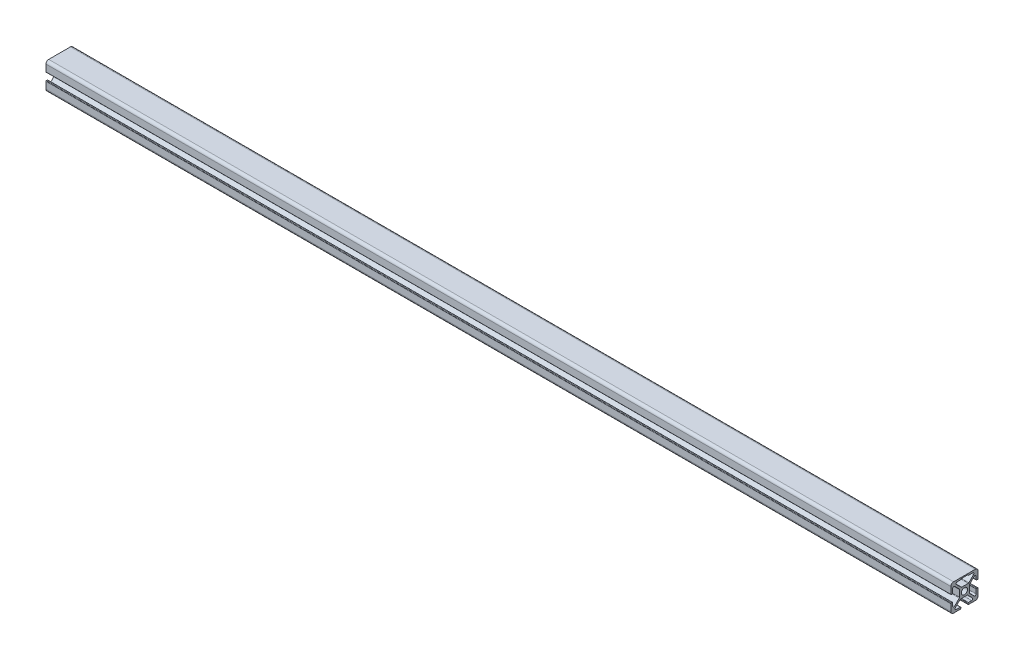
ISO-10303-21;
HEADER;
FILE_DESCRIPTION(('STEP AP214'),'2;1');
FILE_NAME('part.step','',(''),(''),'','','');
FILE_SCHEMA(('AUTOMOTIVE_DESIGN { 1 0 10303 214 1 1 1 1 }'));
ENDSEC;
DATA;
#1=APPLICATION_CONTEXT('core data for automotive mechanical design processes');
#2=APPLICATION_PROTOCOL_DEFINITION('international standard','automotive_design',2000,#1);
#3=PRODUCT_CONTEXT('',#1,'mechanical');
#4=PRODUCT('Part','Part','',(#3));
#5=PRODUCT_RELATED_PRODUCT_CATEGORY('part','',(#4));
#6=PRODUCT_DEFINITION_FORMATION('','',#4);
#7=PRODUCT_DEFINITION_CONTEXT('part definition',#1,'design');
#8=PRODUCT_DEFINITION('design','',#6,#7);
#9=PRODUCT_DEFINITION_SHAPE('','',#8);
#10=(LENGTH_UNIT() NAMED_UNIT(*) SI_UNIT(.MILLI.,.METRE.));
#11=(NAMED_UNIT(*) PLANE_ANGLE_UNIT() SI_UNIT($,.RADIAN.));
#12=(NAMED_UNIT(*) SI_UNIT($,.STERADIAN.) SOLID_ANGLE_UNIT());
#13=UNCERTAINTY_MEASURE_WITH_UNIT(LENGTH_MEASURE(1.E-05),#10,'distance_accuracy_value','');
#14=(GEOMETRIC_REPRESENTATION_CONTEXT(3) GLOBAL_UNCERTAINTY_ASSIGNED_CONTEXT((#13)) GLOBAL_UNIT_ASSIGNED_CONTEXT((#10,
#11,#12)) REPRESENTATION_CONTEXT('',''));
#15=CARTESIAN_POINT('',(0.,0.,0.));
#16=DIRECTION('',(0.,0.,1.));
#17=DIRECTION('',(1.,0.,0.));
#18=AXIS2_PLACEMENT_3D('',#15,#16,#17);
#19=CARTESIAN_POINT('',(1000.,4.5,13.5));
#20=DIRECTION('',(-1.,0.,0.));
#21=DIRECTION('',(0.,0.,1.));
#22=AXIS2_PLACEMENT_3D('',#19,#20,#21);
#23=CYLINDRICAL_SURFACE('',#22,0.5);
#24=CARTESIAN_POINT('',(0.,4.5,13.5));
#25=DIRECTION('',(1.,0.,0.));
#26=DIRECTION('',(0.,0.,-1.));
#27=AXIS2_PLACEMENT_3D('',#24,#25,#26);
#28=CIRCLE('',#27,0.5);
#29=CARTESIAN_POINT('',(0.,4.,13.5));
#30=VERTEX_POINT('',#29);
#31=CARTESIAN_POINT('',(0.,4.5,13.));
#32=VERTEX_POINT('',#31);
#33=EDGE_CURVE('E727',#30,#32,#28,.T.);
#34=ORIENTED_EDGE('',*,*,#33,.T.);
#35=DIRECTION('',(-1.,0.,0.));
#36=VECTOR('',#35,1.);
#37=CARTESIAN_POINT('',(1000.,4.5,13.));
#38=LINE('',#37,#36);
#39=CARTESIAN_POINT('',(1000.,4.5,13.));
#40=VERTEX_POINT('',#39);
#41=EDGE_CURVE('E13',#40,#32,#38,.T.);
#42=ORIENTED_EDGE('',*,*,#41,.F.);
#43=CARTESIAN_POINT('',(1000.,4.5,13.5));
#44=DIRECTION('',(1.,0.,0.));
#45=DIRECTION('',(0.,0.,-1.));
#46=AXIS2_PLACEMENT_3D('',#43,#44,#45);
#47=CIRCLE('',#46,0.5);
#48=CARTESIAN_POINT('',(1000.,4.,13.5));
#49=VERTEX_POINT('',#48);
#50=EDGE_CURVE('E1076',#49,#40,#47,.T.);
#51=ORIENTED_EDGE('',*,*,#50,.F.);
#52=DIRECTION('',(-1.,0.,0.));
#53=VECTOR('',#52,1.);
#54=CARTESIAN_POINT('',(1000.,4.,13.5));
#55=LINE('',#54,#53);
#56=EDGE_CURVE('E838',#49,#30,#55,.T.);
#57=ORIENTED_EDGE('',*,*,#56,.T.);
#58=EDGE_LOOP('',(#34,#42,#51,#57));
#59=FACE_BOUND('',#58,.T.);
#60=ADVANCED_FACE('F210',(#59),#23,.T.);
#61=CARTESIAN_POINT('',(1000.,4.5,13.));
#62=DIRECTION('',(0.,0.,1.));
#63=DIRECTION('',(1.,0.,0.));
#64=AXIS2_PLACEMENT_3D('',#61,#62,#63);
#65=PLANE('',#64);
#66=DIRECTION('',(0.,1.,0.));
#67=VECTOR('',#66,1.);
#68=CARTESIAN_POINT('',(0.,4.5,13.));
#69=LINE('',#68,#67);
#70=CARTESIAN_POINT('',(0.,9.10225830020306,13.));
#71=VERTEX_POINT('',#70);
#72=EDGE_CURVE('E730',#32,#71,#69,.T.);
#73=ORIENTED_EDGE('',*,*,#72,.T.);
#74=DIRECTION('',(-1.,0.,0.));
#75=VECTOR('',#74,1.);
#76=CARTESIAN_POINT('',(1000.,9.10225830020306,13.));
#77=LINE('',#76,#75);
#78=CARTESIAN_POINT('',(1000.,9.10225830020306,13.));
#79=VERTEX_POINT('',#78);
#80=EDGE_CURVE('E220',#79,#71,#77,.T.);
#81=ORIENTED_EDGE('',*,*,#80,.F.);
#82=DIRECTION('',(0.,1.,0.));
#83=VECTOR('',#82,1.);
#84=CARTESIAN_POINT('',(1000.,4.5,13.));
#85=LINE('',#84,#83);
#86=EDGE_CURVE('E1078',#40,#79,#85,.T.);
#87=ORIENTED_EDGE('',*,*,#86,.F.);
#88=ORIENTED_EDGE('',*,*,#41,.T.);
#89=EDGE_LOOP('',(#73,#81,#87,#88));
#90=FACE_BOUND('',#89,.T.);
#91=ADVANCED_FACE('F1208',(#90),#65,.F.);
#92=CARTESIAN_POINT('',(1000.,9.10225830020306,11.702258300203));
#93=DIRECTION('',(-1.,0.,0.));
#94=DIRECTION('',(0.,0.,1.));
#95=AXIS2_PLACEMENT_3D('',#92,#93,#94);
#96=CYLINDRICAL_SURFACE('',#95,1.29774169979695);
#97=CARTESIAN_POINT('',(0.,9.10225830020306,11.702258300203));
#98=DIRECTION('',(-1.,0.,0.));
#99=DIRECTION('',(0.,0.,-1.));
#100=AXIS2_PLACEMENT_3D('',#97,#98,#99);
#101=CIRCLE('',#100,1.29774169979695);
#102=CARTESIAN_POINT('',(0.,10.019900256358,10.7846163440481));
#103=VERTEX_POINT('',#102);
#104=EDGE_CURVE('E732',#71,#103,#101,.T.);
#105=ORIENTED_EDGE('',*,*,#104,.T.);
#106=DIRECTION('',(-1.,0.,0.));
#107=VECTOR('',#106,1.);
#108=CARTESIAN_POINT('',(1000.,10.019900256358,10.7846163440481));
#109=LINE('',#108,#107);
#110=CARTESIAN_POINT('',(1000.,10.019900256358,10.7846163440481));
#111=VERTEX_POINT('',#110);
#112=EDGE_CURVE('E989',#111,#103,#109,.T.);
#113=ORIENTED_EDGE('',*,*,#112,.F.);
#114=CARTESIAN_POINT('',(1000.,9.10225830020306,11.702258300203));
#115=DIRECTION('',(-1.,0.,0.));
#116=DIRECTION('',(0.,0.,-1.));
#117=AXIS2_PLACEMENT_3D('',#114,#115,#116);
#118=CIRCLE('',#117,1.29774169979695);
#119=EDGE_CURVE('E1080',#79,#111,#118,.T.);
#120=ORIENTED_EDGE('',*,*,#119,.F.);
#121=ORIENTED_EDGE('',*,*,#80,.T.);
#122=EDGE_LOOP('',(#105,#113,#120,#121));
#123=FACE_BOUND('',#122,.T.);
#124=ADVANCED_FACE('F1213',(#123),#96,.F.);
#125=CARTESIAN_POINT('',(1000.,10.019900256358,10.7846163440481));
#126=DIRECTION('',(0.,0.707106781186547,-0.707106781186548));
#127=DIRECTION('',(0.,0.707106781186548,0.707106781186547));
#128=AXIS2_PLACEMENT_3D('',#125,#126,#127);
#129=PLANE('',#128);
#130=DIRECTION('',(0.,-0.707106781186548,-0.707106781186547));
#131=VECTOR('',#130,1.);
#132=CARTESIAN_POINT('',(0.,10.019900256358,10.7846163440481));
#133=LINE('',#132,#131);
#134=CARTESIAN_POINT('',(0.,4.92817713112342,5.69289321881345));
#135=VERTEX_POINT('',#134);
#136=EDGE_CURVE('E734',#103,#135,#133,.T.);
#137=ORIENTED_EDGE('',*,*,#136,.T.);
#138=DIRECTION('',(-1.,0.,0.));
#139=VECTOR('',#138,1.);
#140=CARTESIAN_POINT('',(1000.,4.92817713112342,5.69289321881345));
#141=LINE('',#140,#139);
#142=CARTESIAN_POINT('',(1000.,4.92817713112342,5.69289321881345));
#143=VERTEX_POINT('',#142);
#144=EDGE_CURVE('E986',#143,#135,#141,.T.);
#145=ORIENTED_EDGE('',*,*,#144,.F.);
#146=DIRECTION('',(0.,-0.707106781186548,-0.707106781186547));
#147=VECTOR('',#146,1.);
#148=CARTESIAN_POINT('',(1000.,10.019900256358,10.7846163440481));
#149=LINE('',#148,#147);
#150=EDGE_CURVE('E1082',#111,#143,#149,.T.);
#151=ORIENTED_EDGE('',*,*,#150,.F.);
#152=ORIENTED_EDGE('',*,*,#112,.T.);
#153=EDGE_LOOP('',(#137,#145,#151,#152));
#154=FACE_BOUND('',#153,.T.);
#155=ADVANCED_FACE('F1462',(#154),#129,.F.);
#156=CARTESIAN_POINT('',(1000.,4.22107034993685,6.39999999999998));
#157=DIRECTION('',(-1.,0.,0.));
#158=DIRECTION('',(0.,0.,1.));
#159=AXIS2_PLACEMENT_3D('',#156,#157,#158);
#160=CYLINDRICAL_SURFACE('',#159,1.);
#161=CARTESIAN_POINT('',(0.,4.22107034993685,6.39999999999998));
#162=DIRECTION('',(-1.,0.,0.));
#163=DIRECTION('',(0.,0.,-1.));
#164=AXIS2_PLACEMENT_3D('',#161,#162,#163);
#165=CIRCLE('',#164,1.);
#166=CARTESIAN_POINT('',(0.,4.22107034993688,5.39999999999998));
#167=VERTEX_POINT('',#166);
#168=EDGE_CURVE('E736',#135,#167,#165,.T.);
#169=ORIENTED_EDGE('',*,*,#168,.T.);
#170=DIRECTION('',(-1.,0.,0.));
#171=VECTOR('',#170,1.);
#172=CARTESIAN_POINT('',(1000.,4.22107034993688,5.39999999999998));
#173=LINE('',#172,#171);
#174=CARTESIAN_POINT('',(1000.,4.22107034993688,5.39999999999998));
#175=VERTEX_POINT('',#174);
#176=EDGE_CURVE('E983',#175,#167,#173,.T.);
#177=ORIENTED_EDGE('',*,*,#176,.F.);
#178=CARTESIAN_POINT('',(1000.,4.22107034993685,6.39999999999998));
#179=DIRECTION('',(-1.,0.,0.));
#180=DIRECTION('',(0.,0.,-1.));
#181=AXIS2_PLACEMENT_3D('',#178,#179,#180);
#182=CIRCLE('',#181,1.);
#183=EDGE_CURVE('E1084',#143,#175,#182,.T.);
#184=ORIENTED_EDGE('',*,*,#183,.F.);
#185=ORIENTED_EDGE('',*,*,#144,.T.);
#186=EDGE_LOOP('',(#169,#177,#184,#185));
#187=FACE_BOUND('',#186,.T.);
#188=ADVANCED_FACE('F1458',(#187),#160,.F.);
#189=CARTESIAN_POINT('',(1000.,4.22107034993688,5.39999999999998));
#190=DIRECTION('',(0.,0.,-1.));
#191=DIRECTION('',(0.,1.,0.));
#192=AXIS2_PLACEMENT_3D('',#189,#190,#191);
#193=PLANE('',#192);
#194=DIRECTION('',(0.,-1.,0.));
#195=VECTOR('',#194,1.);
#196=CARTESIAN_POINT('',(0.,4.22107034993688,5.39999999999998));
#197=LINE('',#196,#195);
#198=CARTESIAN_POINT('',(0.,-3.02107034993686,5.40000000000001));
#199=VERTEX_POINT('',#198);
#200=EDGE_CURVE('E738',#167,#199,#197,.T.);
#201=ORIENTED_EDGE('',*,*,#200,.T.);
#202=DIRECTION('',(-1.,0.,0.));
#203=VECTOR('',#202,1.);
#204=CARTESIAN_POINT('',(1000.,-3.02107034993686,5.40000000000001));
#205=LINE('',#204,#203);
#206=CARTESIAN_POINT('',(1000.,-3.02107034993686,5.40000000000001));
#207=VERTEX_POINT('',#206);
#208=EDGE_CURVE('E980',#207,#199,#205,.T.);
#209=ORIENTED_EDGE('',*,*,#208,.F.);
#210=DIRECTION('',(0.,-1.,0.));
#211=VECTOR('',#210,1.);
#212=CARTESIAN_POINT('',(1000.,4.22107034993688,5.39999999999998));
#213=LINE('',#212,#211);
#214=EDGE_CURVE('E1086',#175,#207,#213,.T.);
#215=ORIENTED_EDGE('',*,*,#214,.F.);
#216=ORIENTED_EDGE('',*,*,#176,.T.);
#217=EDGE_LOOP('',(#201,#209,#215,#216));
#218=FACE_BOUND('',#217,.T.);
#219=ADVANCED_FACE('F1454',(#218),#193,.F.);
#220=CARTESIAN_POINT('',(1000.,-3.02107034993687,6.39999999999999));
#221=DIRECTION('',(-1.,0.,0.));
#222=DIRECTION('',(0.,0.,1.));
#223=AXIS2_PLACEMENT_3D('',#220,#221,#222);
#224=CYLINDRICAL_SURFACE('',#223,0.999999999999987);
#225=CARTESIAN_POINT('',(0.,-3.02107034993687,6.39999999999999));
#226=DIRECTION('',(-1.,0.,0.));
#227=DIRECTION('',(0.,0.,-1.));
#228=AXIS2_PLACEMENT_3D('',#225,#226,#227);
#229=CIRCLE('',#228,0.999999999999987);
#230=CARTESIAN_POINT('',(0.,-3.7281771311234,5.69289321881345));
#231=VERTEX_POINT('',#230);
#232=EDGE_CURVE('E740',#199,#231,#229,.T.);
#233=ORIENTED_EDGE('',*,*,#232,.T.);
#234=DIRECTION('',(-1.,0.,0.));
#235=VECTOR('',#234,1.);
#236=CARTESIAN_POINT('',(1000.,-3.7281771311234,5.69289321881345));
#237=LINE('',#236,#235);
#238=CARTESIAN_POINT('',(1000.,-3.7281771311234,5.69289321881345));
#239=VERTEX_POINT('',#238);
#240=EDGE_CURVE('E977',#239,#231,#237,.T.);
#241=ORIENTED_EDGE('',*,*,#240,.F.);
#242=CARTESIAN_POINT('',(1000.,-3.02107034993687,6.39999999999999));
#243=DIRECTION('',(-1.,0.,0.));
#244=DIRECTION('',(0.,0.,-1.));
#245=AXIS2_PLACEMENT_3D('',#242,#243,#244);
#246=CIRCLE('',#245,0.999999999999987);
#247=EDGE_CURVE('E1088',#207,#239,#246,.T.);
#248=ORIENTED_EDGE('',*,*,#247,.F.);
#249=ORIENTED_EDGE('',*,*,#208,.T.);
#250=EDGE_LOOP('',(#233,#241,#248,#249));
#251=FACE_BOUND('',#250,.T.);
#252=ADVANCED_FACE('F1450',(#251),#224,.F.);
#253=CARTESIAN_POINT('',(1000.,-3.7281771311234,5.69289321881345));
#254=DIRECTION('',(0.,-0.707106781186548,-0.707106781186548));
#255=DIRECTION('',(0.,0.707106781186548,-0.707106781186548));
#256=AXIS2_PLACEMENT_3D('',#253,#254,#255);
#257=PLANE('',#256);
#258=DIRECTION('',(0.,-0.707106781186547,0.707106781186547));
#259=VECTOR('',#258,1.);
#260=CARTESIAN_POINT('',(0.,-3.7281771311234,5.69289321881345));
#261=LINE('',#260,#259);
#262=CARTESIAN_POINT('',(0.,-8.81990025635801,10.7846163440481));
#263=VERTEX_POINT('',#262);
#264=EDGE_CURVE('E742',#231,#263,#261,.T.);
#265=ORIENTED_EDGE('',*,*,#264,.T.);
#266=DIRECTION('',(-1.,0.,0.));
#267=VECTOR('',#266,1.);
#268=CARTESIAN_POINT('',(1000.,-8.81990025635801,10.7846163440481));
#269=LINE('',#268,#267);
#270=CARTESIAN_POINT('',(1000.,-8.81990025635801,10.7846163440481));
#271=VERTEX_POINT('',#270);
#272=EDGE_CURVE('E974',#271,#263,#269,.T.);
#273=ORIENTED_EDGE('',*,*,#272,.F.);
#274=DIRECTION('',(0.,-0.707106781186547,0.707106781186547));
#275=VECTOR('',#274,1.);
#276=CARTESIAN_POINT('',(1000.,-3.7281771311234,5.69289321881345));
#277=LINE('',#276,#275);
#278=EDGE_CURVE('E1090',#239,#271,#277,.T.);
#279=ORIENTED_EDGE('',*,*,#278,.F.);
#280=ORIENTED_EDGE('',*,*,#240,.T.);
#281=EDGE_LOOP('',(#265,#273,#279,#280));
#282=FACE_BOUND('',#281,.T.);
#283=ADVANCED_FACE('F1446',(#282),#257,.F.);
#284=CARTESIAN_POINT('',(1000.,-7.90225830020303,11.702258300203));
#285=DIRECTION('',(-1.,0.,0.));
#286=DIRECTION('',(0.,0.,1.));
#287=AXIS2_PLACEMENT_3D('',#284,#285,#286);
#288=CYLINDRICAL_SURFACE('',#287,1.29774169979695);
#289=CARTESIAN_POINT('',(0.,-7.90225830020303,11.702258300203));
#290=DIRECTION('',(-1.,0.,0.));
#291=DIRECTION('',(0.,0.,-1.));
#292=AXIS2_PLACEMENT_3D('',#289,#290,#291);
#293=CIRCLE('',#292,1.29774169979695);
#294=CARTESIAN_POINT('',(0.,-7.90225830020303,13.));
#295=VERTEX_POINT('',#294);
#296=EDGE_CURVE('E744',#263,#295,#293,.T.);
#297=ORIENTED_EDGE('',*,*,#296,.T.);
#298=DIRECTION('',(-1.,0.,0.));
#299=VECTOR('',#298,1.);
#300=CARTESIAN_POINT('',(1000.,-7.90225830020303,13.));
#301=LINE('',#300,#299);
#302=CARTESIAN_POINT('',(1000.,-7.90225830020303,13.));
#303=VERTEX_POINT('',#302);
#304=EDGE_CURVE('E971',#303,#295,#301,.T.);
#305=ORIENTED_EDGE('',*,*,#304,.F.);
#306=CARTESIAN_POINT('',(1000.,-7.90225830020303,11.702258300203));
#307=DIRECTION('',(-1.,0.,0.));
#308=DIRECTION('',(0.,0.,-1.));
#309=AXIS2_PLACEMENT_3D('',#306,#307,#308);
#310=CIRCLE('',#309,1.29774169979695);
#311=EDGE_CURVE('E1092',#271,#303,#310,.T.);
#312=ORIENTED_EDGE('',*,*,#311,.F.);
#313=ORIENTED_EDGE('',*,*,#272,.T.);
#314=EDGE_LOOP('',(#297,#305,#312,#313));
#315=FACE_BOUND('',#314,.T.);
#316=ADVANCED_FACE('F1442',(#315),#288,.F.);
#317=CARTESIAN_POINT('',(1000.,-7.90225830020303,13.));
#318=DIRECTION('',(0.,0.,1.));
#319=DIRECTION('',(1.,0.,0.));
#320=AXIS2_PLACEMENT_3D('',#317,#318,#319);
#321=PLANE('',#320);
#322=DIRECTION('',(0.,1.,0.));
#323=VECTOR('',#322,1.);
#324=CARTESIAN_POINT('',(0.,-7.90225830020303,13.));
#325=LINE('',#324,#323);
#326=CARTESIAN_POINT('',(0.,-4.49999999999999,13.));
#327=VERTEX_POINT('',#326);
#328=EDGE_CURVE('E746',#295,#327,#325,.T.);
#329=ORIENTED_EDGE('',*,*,#328,.T.);
#330=DIRECTION('',(-1.,0.,0.));
#331=VECTOR('',#330,1.);
#332=CARTESIAN_POINT('',(1000.,-4.49999999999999,13.));
#333=LINE('',#332,#331);
#334=CARTESIAN_POINT('',(1000.,-4.49999999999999,13.));
#335=VERTEX_POINT('',#334);
#336=EDGE_CURVE('E968',#335,#327,#333,.T.);
#337=ORIENTED_EDGE('',*,*,#336,.F.);
#338=DIRECTION('',(0.,1.,0.));
#339=VECTOR('',#338,1.);
#340=CARTESIAN_POINT('',(1000.,-7.90225830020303,13.));
#341=LINE('',#340,#339);
#342=EDGE_CURVE('E1094',#303,#335,#341,.T.);
#343=ORIENTED_EDGE('',*,*,#342,.F.);
#344=ORIENTED_EDGE('',*,*,#304,.T.);
#345=EDGE_LOOP('',(#329,#337,#343,#344));
#346=FACE_BOUND('',#345,.T.);
#347=ADVANCED_FACE('F1438',(#346),#321,.F.);
#348=CARTESIAN_POINT('',(1000.,-4.49999999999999,13.5));
#349=DIRECTION('',(-1.,0.,0.));
#350=DIRECTION('',(0.,0.,1.));
#351=AXIS2_PLACEMENT_3D('',#348,#349,#350);
#352=CYLINDRICAL_SURFACE('',#351,0.5);
#353=CARTESIAN_POINT('',(0.,-4.49999999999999,13.5));
#354=DIRECTION('',(1.,0.,0.));
#355=DIRECTION('',(0.,0.,-1.));
#356=AXIS2_PLACEMENT_3D('',#353,#354,#355);
#357=CIRCLE('',#356,0.5);
#358=CARTESIAN_POINT('',(0.,-3.99999999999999,13.5));
#359=VERTEX_POINT('',#358);
#360=EDGE_CURVE('E748',#327,#359,#357,.T.);
#361=ORIENTED_EDGE('',*,*,#360,.T.);
#362=DIRECTION('',(-1.,0.,0.));
#363=VECTOR('',#362,1.);
#364=CARTESIAN_POINT('',(1000.,-3.99999999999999,13.5));
#365=LINE('',#364,#363);
#366=CARTESIAN_POINT('',(1000.,-3.99999999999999,13.5));
#367=VERTEX_POINT('',#366);
#368=EDGE_CURVE('E965',#367,#359,#365,.T.);
#369=ORIENTED_EDGE('',*,*,#368,.F.);
#370=CARTESIAN_POINT('',(1000.,-4.49999999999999,13.5));
#371=DIRECTION('',(1.,0.,0.));
#372=DIRECTION('',(0.,0.,-1.));
#373=AXIS2_PLACEMENT_3D('',#370,#371,#372);
#374=CIRCLE('',#373,0.5);
#375=EDGE_CURVE('E1096',#335,#367,#374,.T.);
#376=ORIENTED_EDGE('',*,*,#375,.F.);
#377=ORIENTED_EDGE('',*,*,#336,.T.);
#378=EDGE_LOOP('',(#361,#369,#376,#377));
#379=FACE_BOUND('',#378,.T.);
#380=ADVANCED_FACE('F1434',(#379),#352,.T.);
#381=CARTESIAN_POINT('',(1000.,-3.99999999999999,13.5));
#382=DIRECTION('',(0.,-1.,0.));
#383=DIRECTION('',(0.,0.,-1.));
#384=AXIS2_PLACEMENT_3D('',#381,#382,#383);
#385=PLANE('',#384);
#386=DIRECTION('',(0.,0.,1.));
#387=VECTOR('',#386,1.);
#388=CARTESIAN_POINT('',(0.,-3.99999999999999,13.5));
#389=LINE('',#388,#387);
#390=CARTESIAN_POINT('',(0.,-3.99999999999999,14.5));
#391=VERTEX_POINT('',#390);
#392=EDGE_CURVE('E750',#359,#391,#389,.T.);
#393=ORIENTED_EDGE('',*,*,#392,.T.);
#394=DIRECTION('',(-1.,0.,0.));
#395=VECTOR('',#394,1.);
#396=CARTESIAN_POINT('',(1000.,-3.99999999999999,14.5));
#397=LINE('',#396,#395);
#398=CARTESIAN_POINT('',(1000.,-3.99999999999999,14.5));
#399=VERTEX_POINT('',#398);
#400=EDGE_CURVE('E962',#399,#391,#397,.T.);
#401=ORIENTED_EDGE('',*,*,#400,.F.);
#402=DIRECTION('',(0.,0.,1.));
#403=VECTOR('',#402,1.);
#404=CARTESIAN_POINT('',(1000.,-3.99999999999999,13.5));
#405=LINE('',#404,#403);
#406=EDGE_CURVE('E1098',#367,#399,#405,.T.);
#407=ORIENTED_EDGE('',*,*,#406,.F.);
#408=ORIENTED_EDGE('',*,*,#368,.T.);
#409=EDGE_LOOP('',(#393,#401,#407,#408));
#410=FACE_BOUND('',#409,.T.);
#411=ADVANCED_FACE('F1430',(#410),#385,.F.);
#412=CARTESIAN_POINT('',(1000.,-4.49999999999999,14.5));
#413=DIRECTION('',(-1.,0.,0.));
#414=DIRECTION('',(0.,0.,1.));
#415=AXIS2_PLACEMENT_3D('',#412,#413,#414);
#416=CYLINDRICAL_SURFACE('',#415,0.5);
#417=CARTESIAN_POINT('',(0.,-4.49999999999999,14.5));
#418=DIRECTION('',(1.,0.,0.));
#419=DIRECTION('',(0.,0.,-1.));
#420=AXIS2_PLACEMENT_3D('',#417,#418,#419);
#421=CIRCLE('',#420,0.5);
#422=CARTESIAN_POINT('',(0.,-4.49999999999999,15.));
#423=VERTEX_POINT('',#422);
#424=EDGE_CURVE('E752',#391,#423,#421,.T.);
#425=ORIENTED_EDGE('',*,*,#424,.T.);
#426=DIRECTION('',(-1.,0.,0.));
#427=VECTOR('',#426,1.);
#428=CARTESIAN_POINT('',(1000.,-4.49999999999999,15.));
#429=LINE('',#428,#427);
#430=CARTESIAN_POINT('',(1000.,-4.49999999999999,15.));
#431=VERTEX_POINT('',#430);
#432=EDGE_CURVE('E959',#431,#423,#429,.T.);
#433=ORIENTED_EDGE('',*,*,#432,.F.);
#434=CARTESIAN_POINT('',(1000.,-4.49999999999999,14.5));
#435=DIRECTION('',(1.,0.,0.));
#436=DIRECTION('',(0.,0.,-1.));
#437=AXIS2_PLACEMENT_3D('',#434,#435,#436);
#438=CIRCLE('',#437,0.5);
#439=EDGE_CURVE('E1100',#399,#431,#438,.T.);
#440=ORIENTED_EDGE('',*,*,#439,.F.);
#441=ORIENTED_EDGE('',*,*,#400,.T.);
#442=EDGE_LOOP('',(#425,#433,#440,#441));
#443=FACE_BOUND('',#442,.T.);
#444=ADVANCED_FACE('F1426',(#443),#416,.T.);
#445=CARTESIAN_POINT('',(1000.,-4.49999999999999,15.));
#446=DIRECTION('',(0.,0.,-1.));
#447=DIRECTION('',(-1.,0.,0.));
#448=AXIS2_PLACEMENT_3D('',#445,#446,#447);
#449=PLANE('',#448);
#450=DIRECTION('',(0.,-1.,0.));
#451=VECTOR('',#450,1.);
#452=CARTESIAN_POINT('',(0.,-4.49999999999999,15.));
#453=LINE('',#452,#451);
#454=CARTESIAN_POINT('',(0.,-12.,15.));
#455=VERTEX_POINT('',#454);
#456=EDGE_CURVE('E754',#423,#455,#453,.T.);
#457=ORIENTED_EDGE('',*,*,#456,.T.);
#458=DIRECTION('',(-1.,0.,0.));
#459=VECTOR('',#458,1.);
#460=CARTESIAN_POINT('',(1000.,-12.,15.));
#461=LINE('',#460,#459);
#462=CARTESIAN_POINT('',(1000.,-12.,15.));
#463=VERTEX_POINT('',#462);
#464=EDGE_CURVE('E956',#463,#455,#461,.T.);
#465=ORIENTED_EDGE('',*,*,#464,.F.);
#466=DIRECTION('',(0.,-1.,0.));
#467=VECTOR('',#466,1.);
#468=CARTESIAN_POINT('',(1000.,-4.49999999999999,15.));
#469=LINE('',#468,#467);
#470=EDGE_CURVE('E1102',#431,#463,#469,.T.);
#471=ORIENTED_EDGE('',*,*,#470,.F.);
#472=ORIENTED_EDGE('',*,*,#432,.T.);
#473=EDGE_LOOP('',(#457,#465,#471,#472));
#474=FACE_BOUND('',#473,.T.);
#475=ADVANCED_FACE('F1422',(#474),#449,.F.);
#476=CARTESIAN_POINT('',(1000.,-12.,12.));
#477=DIRECTION('',(-1.,0.,0.));
#478=DIRECTION('',(0.,0.,1.));
#479=AXIS2_PLACEMENT_3D('',#476,#477,#478);
#480=CYLINDRICAL_SURFACE('',#479,3.00000000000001);
#481=CARTESIAN_POINT('',(0.,-12.,12.));
#482=DIRECTION('',(1.,0.,0.));
#483=DIRECTION('',(0.,0.,-1.));
#484=AXIS2_PLACEMENT_3D('',#481,#482,#483);
#485=CIRCLE('',#484,3.00000000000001);
#486=CARTESIAN_POINT('',(0.,-15.,12.));
#487=VERTEX_POINT('',#486);
#488=EDGE_CURVE('E756',#455,#487,#485,.T.);
#489=ORIENTED_EDGE('',*,*,#488,.T.);
#490=DIRECTION('',(-1.,0.,0.));
#491=VECTOR('',#490,1.);
#492=CARTESIAN_POINT('',(1000.,-15.,12.));
#493=LINE('',#492,#491);
#494=CARTESIAN_POINT('',(1000.,-15.,12.));
#495=VERTEX_POINT('',#494);
#496=EDGE_CURVE('E953',#495,#487,#493,.T.);
#497=ORIENTED_EDGE('',*,*,#496,.F.);
#498=CARTESIAN_POINT('',(1000.,-12.,12.));
#499=DIRECTION('',(1.,0.,0.));
#500=DIRECTION('',(0.,0.,-1.));
#501=AXIS2_PLACEMENT_3D('',#498,#499,#500);
#502=CIRCLE('',#501,3.00000000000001);
#503=EDGE_CURVE('E1104',#463,#495,#502,.T.);
#504=ORIENTED_EDGE('',*,*,#503,.F.);
#505=ORIENTED_EDGE('',*,*,#464,.T.);
#506=EDGE_LOOP('',(#489,#497,#504,#505));
#507=FACE_BOUND('',#506,.T.);
#508=ADVANCED_FACE('F1418',(#507),#480,.T.);
#509=CARTESIAN_POINT('',(1000.,-15.,12.));
#510=DIRECTION('',(0.,1.,0.));
#511=DIRECTION('',(0.,0.,1.));
#512=AXIS2_PLACEMENT_3D('',#509,#510,#511);
#513=PLANE('',#512);
#514=DIRECTION('',(0.,0.,-1.));
#515=VECTOR('',#514,1.);
#516=CARTESIAN_POINT('',(0.,-15.,12.));
#517=LINE('',#516,#515);
#518=CARTESIAN_POINT('',(0.,-15.,4.5));
#519=VERTEX_POINT('',#518);
#520=EDGE_CURVE('E758',#487,#519,#517,.T.);
#521=ORIENTED_EDGE('',*,*,#520,.T.);
#522=DIRECTION('',(-1.,0.,0.));
#523=VECTOR('',#522,1.);
#524=CARTESIAN_POINT('',(1000.,-15.,4.5));
#525=LINE('',#524,#523);
#526=CARTESIAN_POINT('',(1000.,-15.,4.5));
#527=VERTEX_POINT('',#526);
#528=EDGE_CURVE('E950',#527,#519,#525,.T.);
#529=ORIENTED_EDGE('',*,*,#528,.F.);
#530=DIRECTION('',(0.,0.,-1.));
#531=VECTOR('',#530,1.);
#532=CARTESIAN_POINT('',(1000.,-15.,12.));
#533=LINE('',#532,#531);
#534=EDGE_CURVE('E1106',#495,#527,#533,.T.);
#535=ORIENTED_EDGE('',*,*,#534,.F.);
#536=ORIENTED_EDGE('',*,*,#496,.T.);
#537=EDGE_LOOP('',(#521,#529,#535,#536));
#538=FACE_BOUND('',#537,.T.);
#539=ADVANCED_FACE('F1414',(#538),#513,.F.);
#540=CARTESIAN_POINT('',(1000.,-14.5,4.5));
#541=DIRECTION('',(-1.,0.,0.));
#542=DIRECTION('',(0.,0.,1.));
#543=AXIS2_PLACEMENT_3D('',#540,#541,#542);
#544=CYLINDRICAL_SURFACE('',#543,0.5);
#545=CARTESIAN_POINT('',(0.,-14.5,4.5));
#546=DIRECTION('',(1.,0.,0.));
#547=DIRECTION('',(0.,0.,-1.));
#548=AXIS2_PLACEMENT_3D('',#545,#546,#547);
#549=CIRCLE('',#548,0.5);
#550=CARTESIAN_POINT('',(0.,-14.5,4.));
#551=VERTEX_POINT('',#550);
#552=EDGE_CURVE('E760',#519,#551,#549,.T.);
#553=ORIENTED_EDGE('',*,*,#552,.T.);
#554=DIRECTION('',(-1.,0.,0.));
#555=VECTOR('',#554,1.);
#556=CARTESIAN_POINT('',(1000.,-14.5,4.));
#557=LINE('',#556,#555);
#558=CARTESIAN_POINT('',(1000.,-14.5,4.));
#559=VERTEX_POINT('',#558);
#560=EDGE_CURVE('E947',#559,#551,#557,.T.);
#561=ORIENTED_EDGE('',*,*,#560,.F.);
#562=CARTESIAN_POINT('',(1000.,-14.5,4.5));
#563=DIRECTION('',(1.,0.,0.));
#564=DIRECTION('',(0.,0.,-1.));
#565=AXIS2_PLACEMENT_3D('',#562,#563,#564);
#566=CIRCLE('',#565,0.5);
#567=EDGE_CURVE('E1108',#527,#559,#566,.T.);
#568=ORIENTED_EDGE('',*,*,#567,.F.);
#569=ORIENTED_EDGE('',*,*,#528,.T.);
#570=EDGE_LOOP('',(#553,#561,#568,#569));
#571=FACE_BOUND('',#570,.T.);
#572=ADVANCED_FACE('F1410',(#571),#544,.T.);
#573=CARTESIAN_POINT('',(1000.,-14.5,4.));
#574=DIRECTION('',(0.,0.,1.));
#575=DIRECTION('',(1.,0.,0.));
#576=AXIS2_PLACEMENT_3D('',#573,#574,#575);
#577=PLANE('',#576);
#578=DIRECTION('',(0.,1.,0.));
#579=VECTOR('',#578,1.);
#580=CARTESIAN_POINT('',(0.,-14.5,4.));
#581=LINE('',#580,#579);
#582=CARTESIAN_POINT('',(0.,-13.5,4.));
#583=VERTEX_POINT('',#582);
#584=EDGE_CURVE('E762',#551,#583,#581,.T.);
#585=ORIENTED_EDGE('',*,*,#584,.T.);
#586=DIRECTION('',(-1.,0.,0.));
#587=VECTOR('',#586,1.);
#588=CARTESIAN_POINT('',(1000.,-13.5,4.));
#589=LINE('',#588,#587);
#590=CARTESIAN_POINT('',(1000.,-13.5,4.));
#591=VERTEX_POINT('',#590);
#592=EDGE_CURVE('E944',#591,#583,#589,.T.);
#593=ORIENTED_EDGE('',*,*,#592,.F.);
#594=DIRECTION('',(0.,1.,0.));
#595=VECTOR('',#594,1.);
#596=CARTESIAN_POINT('',(1000.,-14.5,4.));
#597=LINE('',#596,#595);
#598=EDGE_CURVE('E1110',#559,#591,#597,.T.);
#599=ORIENTED_EDGE('',*,*,#598,.F.);
#600=ORIENTED_EDGE('',*,*,#560,.T.);
#601=EDGE_LOOP('',(#585,#593,#599,#600));
#602=FACE_BOUND('',#601,.T.);
#603=ADVANCED_FACE('F1406',(#602),#577,.F.);
#604=CARTESIAN_POINT('',(1000.,-13.5,4.5));
#605=DIRECTION('',(-1.,0.,0.));
#606=DIRECTION('',(0.,0.,1.));
#607=AXIS2_PLACEMENT_3D('',#604,#605,#606);
#608=CYLINDRICAL_SURFACE('',#607,0.5);
#609=CARTESIAN_POINT('',(0.,-13.5,4.5));
#610=DIRECTION('',(1.,0.,0.));
#611=DIRECTION('',(0.,0.,-1.));
#612=AXIS2_PLACEMENT_3D('',#609,#610,#611);
#613=CIRCLE('',#612,0.5);
#614=CARTESIAN_POINT('',(0.,-13.,4.5));
#615=VERTEX_POINT('',#614);
#616=EDGE_CURVE('E764',#583,#615,#613,.T.);
#617=ORIENTED_EDGE('',*,*,#616,.T.);
#618=DIRECTION('',(-1.,0.,0.));
#619=VECTOR('',#618,1.);
#620=CARTESIAN_POINT('',(1000.,-13.,4.5));
#621=LINE('',#620,#619);
#622=CARTESIAN_POINT('',(1000.,-13.,4.5));
#623=VERTEX_POINT('',#622);
#624=EDGE_CURVE('E941',#623,#615,#621,.T.);
#625=ORIENTED_EDGE('',*,*,#624,.F.);
#626=CARTESIAN_POINT('',(1000.,-13.5,4.5));
#627=DIRECTION('',(1.,0.,0.));
#628=DIRECTION('',(0.,0.,-1.));
#629=AXIS2_PLACEMENT_3D('',#626,#627,#628);
#630=CIRCLE('',#629,0.5);
#631=EDGE_CURVE('E1112',#591,#623,#630,.T.);
#632=ORIENTED_EDGE('',*,*,#631,.F.);
#633=ORIENTED_EDGE('',*,*,#592,.T.);
#634=EDGE_LOOP('',(#617,#625,#632,#633));
#635=FACE_BOUND('',#634,.T.);
#636=ADVANCED_FACE('F1402',(#635),#608,.T.);
#637=CARTESIAN_POINT('',(1000.,-13.,4.5));
#638=DIRECTION('',(0.,-1.,0.));
#639=DIRECTION('',(0.,0.,-1.));
#640=AXIS2_PLACEMENT_3D('',#637,#638,#639);
#641=PLANE('',#640);
#642=DIRECTION('',(0.,0.,1.));
#643=VECTOR('',#642,1.);
#644=CARTESIAN_POINT('',(0.,-13.,4.5));
#645=LINE('',#644,#643);
#646=CARTESIAN_POINT('',(0.,-13.,9.10225830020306));
#647=VERTEX_POINT('',#646);
#648=EDGE_CURVE('E766',#615,#647,#645,.T.);
#649=ORIENTED_EDGE('',*,*,#648,.T.);
#650=DIRECTION('',(-1.,0.,0.));
#651=VECTOR('',#650,1.);
#652=CARTESIAN_POINT('',(1000.,-13.,9.10225830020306));
#653=LINE('',#652,#651);
#654=CARTESIAN_POINT('',(1000.,-13.,9.10225830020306));
#655=VERTEX_POINT('',#654);
#656=EDGE_CURVE('E938',#655,#647,#653,.T.);
#657=ORIENTED_EDGE('',*,*,#656,.F.);
#658=DIRECTION('',(0.,0.,1.));
#659=VECTOR('',#658,1.);
#660=CARTESIAN_POINT('',(1000.,-13.,4.5));
#661=LINE('',#660,#659);
#662=EDGE_CURVE('E1114',#623,#655,#661,.T.);
#663=ORIENTED_EDGE('',*,*,#662,.F.);
#664=ORIENTED_EDGE('',*,*,#624,.T.);
#665=EDGE_LOOP('',(#649,#657,#663,#664));
#666=FACE_BOUND('',#665,.T.);
#667=ADVANCED_FACE('F1398',(#666),#641,.F.);
#668=CARTESIAN_POINT('',(1000.,-11.702258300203,9.10225830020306));
#669=DIRECTION('',(-1.,0.,0.));
#670=DIRECTION('',(0.,0.,1.));
#671=AXIS2_PLACEMENT_3D('',#668,#669,#670);
#672=CYLINDRICAL_SURFACE('',#671,1.29774169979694);
#673=CARTESIAN_POINT('',(0.,-11.702258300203,9.10225830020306));
#674=DIRECTION('',(-1.,0.,0.));
#675=DIRECTION('',(0.,0.,-1.));
#676=AXIS2_PLACEMENT_3D('',#673,#674,#675);
#677=CIRCLE('',#676,1.29774169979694);
#678=CARTESIAN_POINT('',(0.,-10.784616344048,10.019900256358));
#679=VERTEX_POINT('',#678);
#680=EDGE_CURVE('E768',#647,#679,#677,.T.);
#681=ORIENTED_EDGE('',*,*,#680,.T.);
#682=DIRECTION('',(-1.,0.,0.));
#683=VECTOR('',#682,1.);
#684=CARTESIAN_POINT('',(1000.,-10.784616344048,10.019900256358));
#685=LINE('',#684,#683);
#686=CARTESIAN_POINT('',(1000.,-10.784616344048,10.019900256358));
#687=VERTEX_POINT('',#686);
#688=EDGE_CURVE('E935',#687,#679,#685,.T.);
#689=ORIENTED_EDGE('',*,*,#688,.F.);
#690=CARTESIAN_POINT('',(1000.,-11.702258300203,9.10225830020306));
#691=DIRECTION('',(-1.,0.,0.));
#692=DIRECTION('',(0.,0.,-1.));
#693=AXIS2_PLACEMENT_3D('',#690,#691,#692);
#694=CIRCLE('',#693,1.29774169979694);
#695=EDGE_CURVE('E1116',#655,#687,#694,.T.);
#696=ORIENTED_EDGE('',*,*,#695,.F.);
#697=ORIENTED_EDGE('',*,*,#656,.T.);
#698=EDGE_LOOP('',(#681,#689,#696,#697));
#699=FACE_BOUND('',#698,.T.);
#700=ADVANCED_FACE('F1394',(#699),#672,.F.);
#701=CARTESIAN_POINT('',(1000.,-10.784616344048,10.019900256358));
#702=DIRECTION('',(0.,0.707106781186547,0.707106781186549));
#703=DIRECTION('',(0.,-0.707106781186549,0.707106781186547));
#704=AXIS2_PLACEMENT_3D('',#701,#702,#703);
#705=PLANE('',#704);
#706=DIRECTION('',(0.,0.707106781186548,-0.707106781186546));
#707=VECTOR('',#706,1.);
#708=CARTESIAN_POINT('',(0.,-10.784616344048,10.019900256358));
#709=LINE('',#708,#707);
#710=CARTESIAN_POINT('',(0.,-5.69289321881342,4.92817713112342));
#711=VERTEX_POINT('',#710);
#712=EDGE_CURVE('E770',#679,#711,#709,.T.);
#713=ORIENTED_EDGE('',*,*,#712,.T.);
#714=DIRECTION('',(-1.,0.,0.));
#715=VECTOR('',#714,1.);
#716=CARTESIAN_POINT('',(1000.,-5.69289321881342,4.92817713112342));
#717=LINE('',#716,#715);
#718=CARTESIAN_POINT('',(1000.,-5.69289321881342,4.92817713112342));
#719=VERTEX_POINT('',#718);
#720=EDGE_CURVE('E932',#719,#711,#717,.T.);
#721=ORIENTED_EDGE('',*,*,#720,.F.);
#722=DIRECTION('',(0.,0.707106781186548,-0.707106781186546));
#723=VECTOR('',#722,1.);
#724=CARTESIAN_POINT('',(1000.,-10.784616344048,10.019900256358));
#725=LINE('',#724,#723);
#726=EDGE_CURVE('E1118',#687,#719,#725,.T.);
#727=ORIENTED_EDGE('',*,*,#726,.F.);
#728=ORIENTED_EDGE('',*,*,#688,.T.);
#729=EDGE_LOOP('',(#713,#721,#727,#728));
#730=FACE_BOUND('',#729,.T.);
#731=ADVANCED_FACE('F1390',(#730),#705,.F.);
#732=CARTESIAN_POINT('',(1000.,-6.39999999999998,4.22107034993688));
#733=DIRECTION('',(-1.,0.,0.));
#734=DIRECTION('',(0.,0.,1.));
#735=AXIS2_PLACEMENT_3D('',#732,#733,#734);
#736=CYLINDRICAL_SURFACE('',#735,0.999999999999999);
#737=CARTESIAN_POINT('',(0.,-6.39999999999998,4.22107034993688));
#738=DIRECTION('',(-1.,0.,0.));
#739=DIRECTION('',(0.,0.,-1.));
#740=AXIS2_PLACEMENT_3D('',#737,#738,#739);
#741=CIRCLE('',#740,0.999999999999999);
#742=CARTESIAN_POINT('',(0.,-5.39999999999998,4.22107034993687));
#743=VERTEX_POINT('',#742);
#744=EDGE_CURVE('E772',#711,#743,#741,.T.);
#745=ORIENTED_EDGE('',*,*,#744,.T.);
#746=DIRECTION('',(-1.,0.,0.));
#747=VECTOR('',#746,1.);
#748=CARTESIAN_POINT('',(1000.,-5.39999999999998,4.22107034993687));
#749=LINE('',#748,#747);
#750=CARTESIAN_POINT('',(1000.,-5.39999999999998,4.22107034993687));
#751=VERTEX_POINT('',#750);
#752=EDGE_CURVE('E929',#751,#743,#749,.T.);
#753=ORIENTED_EDGE('',*,*,#752,.F.);
#754=CARTESIAN_POINT('',(1000.,-6.39999999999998,4.22107034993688));
#755=DIRECTION('',(-1.,0.,0.));
#756=DIRECTION('',(0.,0.,-1.));
#757=AXIS2_PLACEMENT_3D('',#754,#755,#756);
#758=CIRCLE('',#757,0.999999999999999);
#759=EDGE_CURVE('E1120',#719,#751,#758,.T.);
#760=ORIENTED_EDGE('',*,*,#759,.F.);
#761=ORIENTED_EDGE('',*,*,#720,.T.);
#762=EDGE_LOOP('',(#745,#753,#760,#761));
#763=FACE_BOUND('',#762,.T.);
#764=ADVANCED_FACE('F1386',(#763),#736,.F.);
#765=CARTESIAN_POINT('',(1000.,-5.39999999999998,4.22107034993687));
#766=DIRECTION('',(0.,1.,0.));
#767=DIRECTION('',(0.,0.,1.));
#768=AXIS2_PLACEMENT_3D('',#765,#766,#767);
#769=PLANE('',#768);
#770=DIRECTION('',(0.,0.,-1.));
#771=VECTOR('',#770,1.);
#772=CARTESIAN_POINT('',(0.,-5.39999999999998,4.22107034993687));
#773=LINE('',#772,#771);
#774=CARTESIAN_POINT('',(0.,-5.39999999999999,-3.02107034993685));
#775=VERTEX_POINT('',#774);
#776=EDGE_CURVE('E774',#743,#775,#773,.T.);
#777=ORIENTED_EDGE('',*,*,#776,.T.);
#778=DIRECTION('',(-1.,0.,0.));
#779=VECTOR('',#778,1.);
#780=CARTESIAN_POINT('',(1000.,-5.39999999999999,-3.02107034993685));
#781=LINE('',#780,#779);
#782=CARTESIAN_POINT('',(1000.,-5.39999999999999,-3.02107034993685));
#783=VERTEX_POINT('',#782);
#784=EDGE_CURVE('E926',#783,#775,#781,.T.);
#785=ORIENTED_EDGE('',*,*,#784,.F.);
#786=DIRECTION('',(0.,0.,-1.));
#787=VECTOR('',#786,1.);
#788=CARTESIAN_POINT('',(1000.,-5.39999999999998,4.22107034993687));
#789=LINE('',#788,#787);
#790=EDGE_CURVE('E1122',#751,#783,#789,.T.);
#791=ORIENTED_EDGE('',*,*,#790,.F.);
#792=ORIENTED_EDGE('',*,*,#752,.T.);
#793=EDGE_LOOP('',(#777,#785,#791,#792));
#794=FACE_BOUND('',#793,.T.);
#795=ADVANCED_FACE('F1382',(#794),#769,.F.);
#796=CARTESIAN_POINT('',(1000.,-6.4,-3.02107034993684));
#797=DIRECTION('',(-1.,0.,0.));
#798=DIRECTION('',(0.,0.,1.));
#799=AXIS2_PLACEMENT_3D('',#796,#797,#798);
#800=CYLINDRICAL_SURFACE('',#799,1.00000000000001);
#801=CARTESIAN_POINT('',(0.,-6.4,-3.02107034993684));
#802=DIRECTION('',(-1.,0.,0.));
#803=DIRECTION('',(0.,0.,-1.));
#804=AXIS2_PLACEMENT_3D('',#801,#802,#803);
#805=CIRCLE('',#804,1.00000000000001);
#806=CARTESIAN_POINT('',(0.,-5.69289321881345,-3.7281771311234));
#807=VERTEX_POINT('',#806);
#808=EDGE_CURVE('E776',#775,#807,#805,.T.);
#809=ORIENTED_EDGE('',*,*,#808,.T.);
#810=DIRECTION('',(-1.,0.,0.));
#811=VECTOR('',#810,1.);
#812=CARTESIAN_POINT('',(1000.,-5.69289321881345,-3.7281771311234));
#813=LINE('',#812,#811);
#814=CARTESIAN_POINT('',(1000.,-5.69289321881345,-3.7281771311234));
#815=VERTEX_POINT('',#814);
#816=EDGE_CURVE('E923',#815,#807,#813,.T.);
#817=ORIENTED_EDGE('',*,*,#816,.F.);
#818=CARTESIAN_POINT('',(1000.,-6.4,-3.02107034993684));
#819=DIRECTION('',(-1.,0.,0.));
#820=DIRECTION('',(0.,0.,-1.));
#821=AXIS2_PLACEMENT_3D('',#818,#819,#820);
#822=CIRCLE('',#821,1.00000000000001);
#823=EDGE_CURVE('E1124',#783,#815,#822,.T.);
#824=ORIENTED_EDGE('',*,*,#823,.F.);
#825=ORIENTED_EDGE('',*,*,#784,.T.);
#826=EDGE_LOOP('',(#809,#817,#824,#825));
#827=FACE_BOUND('',#826,.T.);
#828=ADVANCED_FACE('F1378',(#827),#800,.F.);
#829=CARTESIAN_POINT('',(1000.,-5.69289321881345,-3.7281771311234));
#830=DIRECTION('',(0.,0.707106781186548,-0.707106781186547));
#831=DIRECTION('',(0.,0.707106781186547,0.707106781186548));
#832=AXIS2_PLACEMENT_3D('',#829,#830,#831);
#833=PLANE('',#832);
#834=DIRECTION('',(0.,-0.707106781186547,-0.707106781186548));
#835=VECTOR('',#834,1.);
#836=CARTESIAN_POINT('',(0.,-5.69289321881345,-3.7281771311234));
#837=LINE('',#836,#835);
#838=CARTESIAN_POINT('',(0.,-10.784616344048,-8.81990025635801));
#839=VERTEX_POINT('',#838);
#840=EDGE_CURVE('E778',#807,#839,#837,.T.);
#841=ORIENTED_EDGE('',*,*,#840,.T.);
#842=DIRECTION('',(-1.,0.,0.));
#843=VECTOR('',#842,1.);
#844=CARTESIAN_POINT('',(1000.,-10.784616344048,-8.81990025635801));
#845=LINE('',#844,#843);
#846=CARTESIAN_POINT('',(1000.,-10.784616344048,-8.81990025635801));
#847=VERTEX_POINT('',#846);
#848=EDGE_CURVE('E920',#847,#839,#845,.T.);
#849=ORIENTED_EDGE('',*,*,#848,.F.);
#850=DIRECTION('',(0.,-0.707106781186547,-0.707106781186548));
#851=VECTOR('',#850,1.);
#852=CARTESIAN_POINT('',(1000.,-5.69289321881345,-3.7281771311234));
#853=LINE('',#852,#851);
#854=EDGE_CURVE('E1126',#815,#847,#853,.T.);
#855=ORIENTED_EDGE('',*,*,#854,.F.);
#856=ORIENTED_EDGE('',*,*,#816,.T.);
#857=EDGE_LOOP('',(#841,#849,#855,#856));
#858=FACE_BOUND('',#857,.T.);
#859=ADVANCED_FACE('F1374',(#858),#833,.F.);
#860=CARTESIAN_POINT('',(1000.,-11.702258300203,-7.90225830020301));
#861=DIRECTION('',(-1.,0.,0.));
#862=DIRECTION('',(0.,0.,1.));
#863=AXIS2_PLACEMENT_3D('',#860,#861,#862);
#864=CYLINDRICAL_SURFACE('',#863,1.29774169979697);
#865=CARTESIAN_POINT('',(0.,-11.702258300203,-7.90225830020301));
#866=DIRECTION('',(-1.,0.,0.));
#867=DIRECTION('',(0.,0.,-1.));
#868=AXIS2_PLACEMENT_3D('',#865,#866,#867);
#869=CIRCLE('',#868,1.29774169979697);
#870=CARTESIAN_POINT('',(0.,-13.,-7.90225830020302));
#871=VERTEX_POINT('',#870);
#872=EDGE_CURVE('E780',#839,#871,#869,.T.);
#873=ORIENTED_EDGE('',*,*,#872,.T.);
#874=DIRECTION('',(-1.,0.,0.));
#875=VECTOR('',#874,1.);
#876=CARTESIAN_POINT('',(1000.,-13.,-7.90225830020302));
#877=LINE('',#876,#875);
#878=CARTESIAN_POINT('',(1000.,-13.,-7.90225830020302));
#879=VERTEX_POINT('',#878);
#880=EDGE_CURVE('E917',#879,#871,#877,.T.);
#881=ORIENTED_EDGE('',*,*,#880,.F.);
#882=CARTESIAN_POINT('',(1000.,-11.702258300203,-7.90225830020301));
#883=DIRECTION('',(-1.,0.,0.));
#884=DIRECTION('',(0.,0.,-1.));
#885=AXIS2_PLACEMENT_3D('',#882,#883,#884);
#886=CIRCLE('',#885,1.29774169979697);
#887=EDGE_CURVE('E1128',#847,#879,#886,.T.);
#888=ORIENTED_EDGE('',*,*,#887,.F.);
#889=ORIENTED_EDGE('',*,*,#848,.T.);
#890=EDGE_LOOP('',(#873,#881,#888,#889));
#891=FACE_BOUND('',#890,.T.);
#892=ADVANCED_FACE('F1370',(#891),#864,.F.);
#893=CARTESIAN_POINT('',(1000.,-13.,-7.90225830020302));
#894=DIRECTION('',(0.,-1.,0.));
#895=DIRECTION('',(0.,0.,-1.));
#896=AXIS2_PLACEMENT_3D('',#893,#894,#895);
#897=PLANE('',#896);
#898=DIRECTION('',(0.,0.,1.));
#899=VECTOR('',#898,1.);
#900=CARTESIAN_POINT('',(0.,-13.,-7.90225830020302));
#901=LINE('',#900,#899);
#902=CARTESIAN_POINT('',(0.,-13.,-4.5));
#903=VERTEX_POINT('',#902);
#904=EDGE_CURVE('E782',#871,#903,#901,.T.);
#905=ORIENTED_EDGE('',*,*,#904,.T.);
#906=DIRECTION('',(-1.,0.,0.));
#907=VECTOR('',#906,1.);
#908=CARTESIAN_POINT('',(1000.,-13.,-4.5));
#909=LINE('',#908,#907);
#910=CARTESIAN_POINT('',(1000.,-13.,-4.5));
#911=VERTEX_POINT('',#910);
#912=EDGE_CURVE('E914',#911,#903,#909,.T.);
#913=ORIENTED_EDGE('',*,*,#912,.F.);
#914=DIRECTION('',(0.,0.,1.));
#915=VECTOR('',#914,1.);
#916=CARTESIAN_POINT('',(1000.,-13.,-7.90225830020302));
#917=LINE('',#916,#915);
#918=EDGE_CURVE('E1130',#879,#911,#917,.T.);
#919=ORIENTED_EDGE('',*,*,#918,.F.);
#920=ORIENTED_EDGE('',*,*,#880,.T.);
#921=EDGE_LOOP('',(#905,#913,#919,#920));
#922=FACE_BOUND('',#921,.T.);
#923=ADVANCED_FACE('F1366',(#922),#897,.F.);
#924=CARTESIAN_POINT('',(1000.,-13.5,-4.5));
#925=DIRECTION('',(-1.,0.,0.));
#926=DIRECTION('',(0.,0.,1.));
#927=AXIS2_PLACEMENT_3D('',#924,#925,#926);
#928=CYLINDRICAL_SURFACE('',#927,0.5);
#929=CARTESIAN_POINT('',(0.,-13.5,-4.5));
#930=DIRECTION('',(1.,0.,0.));
#931=DIRECTION('',(0.,0.,-1.));
#932=AXIS2_PLACEMENT_3D('',#929,#930,#931);
#933=CIRCLE('',#932,0.5);
#934=CARTESIAN_POINT('',(0.,-13.5,-4.));
#935=VERTEX_POINT('',#934);
#936=EDGE_CURVE('E784',#903,#935,#933,.T.);
#937=ORIENTED_EDGE('',*,*,#936,.T.);
#938=DIRECTION('',(-1.,0.,0.));
#939=VECTOR('',#938,1.);
#940=CARTESIAN_POINT('',(1000.,-13.5,-4.));
#941=LINE('',#940,#939);
#942=CARTESIAN_POINT('',(1000.,-13.5,-4.));
#943=VERTEX_POINT('',#942);
#944=EDGE_CURVE('E911',#943,#935,#941,.T.);
#945=ORIENTED_EDGE('',*,*,#944,.F.);
#946=CARTESIAN_POINT('',(1000.,-13.5,-4.5));
#947=DIRECTION('',(1.,0.,0.));
#948=DIRECTION('',(0.,0.,-1.));
#949=AXIS2_PLACEMENT_3D('',#946,#947,#948);
#950=CIRCLE('',#949,0.5);
#951=EDGE_CURVE('E1132',#911,#943,#950,.T.);
#952=ORIENTED_EDGE('',*,*,#951,.F.);
#953=ORIENTED_EDGE('',*,*,#912,.T.);
#954=EDGE_LOOP('',(#937,#945,#952,#953));
#955=FACE_BOUND('',#954,.T.);
#956=ADVANCED_FACE('F1362',(#955),#928,.T.);
#957=CARTESIAN_POINT('',(1000.,-13.5,-4.));
#958=DIRECTION('',(0.,0.,-1.));
#959=DIRECTION('',(-1.,0.,0.));
#960=AXIS2_PLACEMENT_3D('',#957,#958,#959);
#961=PLANE('',#960);
#962=DIRECTION('',(0.,-1.,0.));
#963=VECTOR('',#962,1.);
#964=CARTESIAN_POINT('',(0.,-13.5,-4.));
#965=LINE('',#964,#963);
#966=CARTESIAN_POINT('',(0.,-14.5,-4.));
#967=VERTEX_POINT('',#966);
#968=EDGE_CURVE('E786',#935,#967,#965,.T.);
#969=ORIENTED_EDGE('',*,*,#968,.T.);
#970=DIRECTION('',(-1.,0.,0.));
#971=VECTOR('',#970,1.);
#972=CARTESIAN_POINT('',(1000.,-14.5,-4.));
#973=LINE('',#972,#971);
#974=CARTESIAN_POINT('',(1000.,-14.5,-4.));
#975=VERTEX_POINT('',#974);
#976=EDGE_CURVE('E908',#975,#967,#973,.T.);
#977=ORIENTED_EDGE('',*,*,#976,.F.);
#978=DIRECTION('',(0.,-1.,0.));
#979=VECTOR('',#978,1.);
#980=CARTESIAN_POINT('',(1000.,-13.5,-4.));
#981=LINE('',#980,#979);
#982=EDGE_CURVE('E1134',#943,#975,#981,.T.);
#983=ORIENTED_EDGE('',*,*,#982,.F.);
#984=ORIENTED_EDGE('',*,*,#944,.T.);
#985=EDGE_LOOP('',(#969,#977,#983,#984));
#986=FACE_BOUND('',#985,.T.);
#987=ADVANCED_FACE('F1358',(#986),#961,.F.);
#988=CARTESIAN_POINT('',(1000.,-14.5,-4.5));
#989=DIRECTION('',(-1.,0.,0.));
#990=DIRECTION('',(0.,0.,1.));
#991=AXIS2_PLACEMENT_3D('',#988,#989,#990);
#992=CYLINDRICAL_SURFACE('',#991,0.5);
#993=CARTESIAN_POINT('',(0.,-14.5,-4.5));
#994=DIRECTION('',(1.,0.,0.));
#995=DIRECTION('',(0.,0.,-1.));
#996=AXIS2_PLACEMENT_3D('',#993,#994,#995);
#997=CIRCLE('',#996,0.5);
#998=CARTESIAN_POINT('',(0.,-15.,-4.5));
#999=VERTEX_POINT('',#998);
#1000=EDGE_CURVE('E788',#967,#999,#997,.T.);
#1001=ORIENTED_EDGE('',*,*,#1000,.T.);
#1002=DIRECTION('',(-1.,0.,0.));
#1003=VECTOR('',#1002,1.);
#1004=CARTESIAN_POINT('',(1000.,-15.,-4.5));
#1005=LINE('',#1004,#1003);
#1006=CARTESIAN_POINT('',(1000.,-15.,-4.5));
#1007=VERTEX_POINT('',#1006);
#1008=EDGE_CURVE('E905',#1007,#999,#1005,.T.);
#1009=ORIENTED_EDGE('',*,*,#1008,.F.);
#1010=CARTESIAN_POINT('',(1000.,-14.5,-4.5));
#1011=DIRECTION('',(1.,0.,0.));
#1012=DIRECTION('',(0.,0.,-1.));
#1013=AXIS2_PLACEMENT_3D('',#1010,#1011,#1012);
#1014=CIRCLE('',#1013,0.5);
#1015=EDGE_CURVE('E1136',#975,#1007,#1014,.T.);
#1016=ORIENTED_EDGE('',*,*,#1015,.F.);
#1017=ORIENTED_EDGE('',*,*,#976,.T.);
#1018=EDGE_LOOP('',(#1001,#1009,#1016,#1017));
#1019=FACE_BOUND('',#1018,.T.);
#1020=ADVANCED_FACE('F1354',(#1019),#992,.T.);
#1021=CARTESIAN_POINT('',(1000.,-15.,-4.5));
#1022=DIRECTION('',(0.,1.,0.));
#1023=DIRECTION('',(0.,0.,1.));
#1024=AXIS2_PLACEMENT_3D('',#1021,#1022,#1023);
#1025=PLANE('',#1024);
#1026=DIRECTION('',(0.,0.,-1.));
#1027=VECTOR('',#1026,1.);
#1028=CARTESIAN_POINT('',(0.,-15.,-4.5));
#1029=LINE('',#1028,#1027);
#1030=CARTESIAN_POINT('',(0.,-15.,-12.));
#1031=VERTEX_POINT('',#1030);
#1032=EDGE_CURVE('E790',#999,#1031,#1029,.T.);
#1033=ORIENTED_EDGE('',*,*,#1032,.T.);
#1034=DIRECTION('',(-1.,0.,0.));
#1035=VECTOR('',#1034,1.);
#1036=CARTESIAN_POINT('',(1000.,-15.,-12.));
#1037=LINE('',#1036,#1035);
#1038=CARTESIAN_POINT('',(1000.,-15.,-12.));
#1039=VERTEX_POINT('',#1038);
#1040=EDGE_CURVE('E902',#1039,#1031,#1037,.T.);
#1041=ORIENTED_EDGE('',*,*,#1040,.F.);
#1042=DIRECTION('',(0.,0.,-1.));
#1043=VECTOR('',#1042,1.);
#1044=CARTESIAN_POINT('',(1000.,-15.,-4.5));
#1045=LINE('',#1044,#1043);
#1046=EDGE_CURVE('E1138',#1007,#1039,#1045,.T.);
#1047=ORIENTED_EDGE('',*,*,#1046,.F.);
#1048=ORIENTED_EDGE('',*,*,#1008,.T.);
#1049=EDGE_LOOP('',(#1033,#1041,#1047,#1048));
#1050=FACE_BOUND('',#1049,.T.);
#1051=ADVANCED_FACE('F1350',(#1050),#1025,.F.);
#1052=CARTESIAN_POINT('',(1000.,-12.,-12.));
#1053=DIRECTION('',(-1.,0.,0.));
#1054=DIRECTION('',(0.,0.,1.));
#1055=AXIS2_PLACEMENT_3D('',#1052,#1053,#1054);
#1056=CYLINDRICAL_SURFACE('',#1055,3.00000000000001);
#1057=CARTESIAN_POINT('',(0.,-12.,-12.));
#1058=DIRECTION('',(1.,0.,0.));
#1059=DIRECTION('',(0.,0.,-1.));
#1060=AXIS2_PLACEMENT_3D('',#1057,#1058,#1059);
#1061=CIRCLE('',#1060,3.00000000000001);
#1062=CARTESIAN_POINT('',(0.,-12.,-15.));
#1063=VERTEX_POINT('',#1062);
#1064=EDGE_CURVE('E792',#1031,#1063,#1061,.T.);
#1065=ORIENTED_EDGE('',*,*,#1064,.T.);
#1066=DIRECTION('',(-1.,0.,0.));
#1067=VECTOR('',#1066,1.);
#1068=CARTESIAN_POINT('',(1000.,-12.,-15.));
#1069=LINE('',#1068,#1067);
#1070=CARTESIAN_POINT('',(1000.,-12.,-15.));
#1071=VERTEX_POINT('',#1070);
#1072=EDGE_CURVE('E899',#1071,#1063,#1069,.T.);
#1073=ORIENTED_EDGE('',*,*,#1072,.F.);
#1074=CARTESIAN_POINT('',(1000.,-12.,-12.));
#1075=DIRECTION('',(1.,0.,0.));
#1076=DIRECTION('',(0.,0.,-1.));
#1077=AXIS2_PLACEMENT_3D('',#1074,#1075,#1076);
#1078=CIRCLE('',#1077,3.00000000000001);
#1079=EDGE_CURVE('E1140',#1039,#1071,#1078,.T.);
#1080=ORIENTED_EDGE('',*,*,#1079,.F.);
#1081=ORIENTED_EDGE('',*,*,#1040,.T.);
#1082=EDGE_LOOP('',(#1065,#1073,#1080,#1081));
#1083=FACE_BOUND('',#1082,.T.);
#1084=ADVANCED_FACE('F1346',(#1083),#1056,.T.);
#1085=CARTESIAN_POINT('',(1000.,-12.,-15.));
#1086=DIRECTION('',(0.,0.,1.));
#1087=DIRECTION('',(1.,0.,0.));
#1088=AXIS2_PLACEMENT_3D('',#1085,#1086,#1087);
#1089=PLANE('',#1088);
#1090=DIRECTION('',(0.,1.,0.));
#1091=VECTOR('',#1090,1.);
#1092=CARTESIAN_POINT('',(0.,-12.,-15.));
#1093=LINE('',#1092,#1091);
#1094=CARTESIAN_POINT('',(0.,-4.49999999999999,-15.));
#1095=VERTEX_POINT('',#1094);
#1096=EDGE_CURVE('E794',#1063,#1095,#1093,.T.);
#1097=ORIENTED_EDGE('',*,*,#1096,.T.);
#1098=DIRECTION('',(-1.,0.,0.));
#1099=VECTOR('',#1098,1.);
#1100=CARTESIAN_POINT('',(1000.,-4.49999999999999,-15.));
#1101=LINE('',#1100,#1099);
#1102=CARTESIAN_POINT('',(1000.,-4.49999999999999,-15.));
#1103=VERTEX_POINT('',#1102);
#1104=EDGE_CURVE('E896',#1103,#1095,#1101,.T.);
#1105=ORIENTED_EDGE('',*,*,#1104,.F.);
#1106=DIRECTION('',(0.,1.,0.));
#1107=VECTOR('',#1106,1.);
#1108=CARTESIAN_POINT('',(1000.,-12.,-15.));
#1109=LINE('',#1108,#1107);
#1110=EDGE_CURVE('E1142',#1071,#1103,#1109,.T.);
#1111=ORIENTED_EDGE('',*,*,#1110,.F.);
#1112=ORIENTED_EDGE('',*,*,#1072,.T.);
#1113=EDGE_LOOP('',(#1097,#1105,#1111,#1112));
#1114=FACE_BOUND('',#1113,.T.);
#1115=ADVANCED_FACE('F1342',(#1114),#1089,.F.);
#1116=CARTESIAN_POINT('',(1000.,-4.49999999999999,-14.5));
#1117=DIRECTION('',(-1.,0.,0.));
#1118=DIRECTION('',(0.,0.,1.));
#1119=AXIS2_PLACEMENT_3D('',#1116,#1117,#1118);
#1120=CYLINDRICAL_SURFACE('',#1119,0.5);
#1121=CARTESIAN_POINT('',(0.,-4.49999999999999,-14.5));
#1122=DIRECTION('',(1.,0.,0.));
#1123=DIRECTION('',(0.,0.,-1.));
#1124=AXIS2_PLACEMENT_3D('',#1121,#1122,#1123);
#1125=CIRCLE('',#1124,0.5);
#1126=CARTESIAN_POINT('',(0.,-3.99999999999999,-14.5));
#1127=VERTEX_POINT('',#1126);
#1128=EDGE_CURVE('E796',#1095,#1127,#1125,.T.);
#1129=ORIENTED_EDGE('',*,*,#1128,.T.);
#1130=DIRECTION('',(-1.,0.,0.));
#1131=VECTOR('',#1130,1.);
#1132=CARTESIAN_POINT('',(1000.,-3.99999999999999,-14.5));
#1133=LINE('',#1132,#1131);
#1134=CARTESIAN_POINT('',(1000.,-3.99999999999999,-14.5));
#1135=VERTEX_POINT('',#1134);
#1136=EDGE_CURVE('E893',#1135,#1127,#1133,.T.);
#1137=ORIENTED_EDGE('',*,*,#1136,.F.);
#1138=CARTESIAN_POINT('',(1000.,-4.49999999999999,-14.5));
#1139=DIRECTION('',(1.,0.,0.));
#1140=DIRECTION('',(0.,0.,-1.));
#1141=AXIS2_PLACEMENT_3D('',#1138,#1139,#1140);
#1142=CIRCLE('',#1141,0.5);
#1143=EDGE_CURVE('E1144',#1103,#1135,#1142,.T.);
#1144=ORIENTED_EDGE('',*,*,#1143,.F.);
#1145=ORIENTED_EDGE('',*,*,#1104,.T.);
#1146=EDGE_LOOP('',(#1129,#1137,#1144,#1145));
#1147=FACE_BOUND('',#1146,.T.);
#1148=ADVANCED_FACE('F1338',(#1147),#1120,.T.);
#1149=CARTESIAN_POINT('',(1000.,-3.99999999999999,-14.5));
#1150=DIRECTION('',(0.,-1.,0.));
#1151=DIRECTION('',(0.,0.,-1.));
#1152=AXIS2_PLACEMENT_3D('',#1149,#1150,#1151);
#1153=PLANE('',#1152);
#1154=DIRECTION('',(0.,0.,1.));
#1155=VECTOR('',#1154,1.);
#1156=CARTESIAN_POINT('',(0.,-3.99999999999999,-14.5));
#1157=LINE('',#1156,#1155);
#1158=CARTESIAN_POINT('',(0.,-4.,-13.5));
#1159=VERTEX_POINT('',#1158);
#1160=EDGE_CURVE('E798',#1127,#1159,#1157,.T.);
#1161=ORIENTED_EDGE('',*,*,#1160,.T.);
#1162=DIRECTION('',(-1.,0.,0.));
#1163=VECTOR('',#1162,1.);
#1164=CARTESIAN_POINT('',(1000.,-4.,-13.5));
#1165=LINE('',#1164,#1163);
#1166=CARTESIAN_POINT('',(1000.,-4.,-13.5));
#1167=VERTEX_POINT('',#1166);
#1168=EDGE_CURVE('E890',#1167,#1159,#1165,.T.);
#1169=ORIENTED_EDGE('',*,*,#1168,.F.);
#1170=DIRECTION('',(0.,0.,1.));
#1171=VECTOR('',#1170,1.);
#1172=CARTESIAN_POINT('',(1000.,-3.99999999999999,-14.5));
#1173=LINE('',#1172,#1171);
#1174=EDGE_CURVE('E1146',#1135,#1167,#1173,.T.);
#1175=ORIENTED_EDGE('',*,*,#1174,.F.);
#1176=ORIENTED_EDGE('',*,*,#1136,.T.);
#1177=EDGE_LOOP('',(#1161,#1169,#1175,#1176));
#1178=FACE_BOUND('',#1177,.T.);
#1179=ADVANCED_FACE('F1334',(#1178),#1153,.F.);
#1180=CARTESIAN_POINT('',(1000.,-4.5,-13.5));
#1181=DIRECTION('',(-1.,0.,0.));
#1182=DIRECTION('',(0.,0.,1.));
#1183=AXIS2_PLACEMENT_3D('',#1180,#1181,#1182);
#1184=CYLINDRICAL_SURFACE('',#1183,0.5);
#1185=CARTESIAN_POINT('',(0.,-4.5,-13.5));
#1186=DIRECTION('',(1.,0.,0.));
#1187=DIRECTION('',(0.,0.,-1.));
#1188=AXIS2_PLACEMENT_3D('',#1185,#1186,#1187);
#1189=CIRCLE('',#1188,0.5);
#1190=CARTESIAN_POINT('',(0.,-4.5,-13.));
#1191=VERTEX_POINT('',#1190);
#1192=EDGE_CURVE('E800',#1159,#1191,#1189,.T.);
#1193=ORIENTED_EDGE('',*,*,#1192,.T.);
#1194=DIRECTION('',(-1.,0.,0.));
#1195=VECTOR('',#1194,1.);
#1196=CARTESIAN_POINT('',(1000.,-4.5,-13.));
#1197=LINE('',#1196,#1195);
#1198=CARTESIAN_POINT('',(1000.,-4.5,-13.));
#1199=VERTEX_POINT('',#1198);
#1200=EDGE_CURVE('E887',#1199,#1191,#1197,.T.);
#1201=ORIENTED_EDGE('',*,*,#1200,.F.);
#1202=CARTESIAN_POINT('',(1000.,-4.5,-13.5));
#1203=DIRECTION('',(1.,0.,0.));
#1204=DIRECTION('',(0.,0.,-1.));
#1205=AXIS2_PLACEMENT_3D('',#1202,#1203,#1204);
#1206=CIRCLE('',#1205,0.5);
#1207=EDGE_CURVE('E1148',#1167,#1199,#1206,.T.);
#1208=ORIENTED_EDGE('',*,*,#1207,.F.);
#1209=ORIENTED_EDGE('',*,*,#1168,.T.);
#1210=EDGE_LOOP('',(#1193,#1201,#1208,#1209));
#1211=FACE_BOUND('',#1210,.T.);
#1212=ADVANCED_FACE('F1330',(#1211),#1184,.T.);
#1213=CARTESIAN_POINT('',(1000.,-4.5,-13.));
#1214=DIRECTION('',(0.,0.,-1.));
#1215=DIRECTION('',(-1.,0.,0.));
#1216=AXIS2_PLACEMENT_3D('',#1213,#1214,#1215);
#1217=PLANE('',#1216);
#1218=DIRECTION('',(0.,-1.,0.));
#1219=VECTOR('',#1218,1.);
#1220=CARTESIAN_POINT('',(0.,-4.5,-13.));
#1221=LINE('',#1220,#1219);
#1222=CARTESIAN_POINT('',(0.,-9.10225830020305,-13.));
#1223=VERTEX_POINT('',#1222);
#1224=EDGE_CURVE('E802',#1191,#1223,#1221,.T.);
#1225=ORIENTED_EDGE('',*,*,#1224,.T.);
#1226=DIRECTION('',(-1.,0.,0.));
#1227=VECTOR('',#1226,1.);
#1228=CARTESIAN_POINT('',(1000.,-9.10225830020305,-13.));
#1229=LINE('',#1228,#1227);
#1230=CARTESIAN_POINT('',(1000.,-9.10225830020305,-13.));
#1231=VERTEX_POINT('',#1230);
#1232=EDGE_CURVE('E884',#1231,#1223,#1229,.T.);
#1233=ORIENTED_EDGE('',*,*,#1232,.F.);
#1234=DIRECTION('',(0.,-1.,0.));
#1235=VECTOR('',#1234,1.);
#1236=CARTESIAN_POINT('',(1000.,-4.5,-13.));
#1237=LINE('',#1236,#1235);
#1238=EDGE_CURVE('E1150',#1199,#1231,#1237,.T.);
#1239=ORIENTED_EDGE('',*,*,#1238,.F.);
#1240=ORIENTED_EDGE('',*,*,#1200,.T.);
#1241=EDGE_LOOP('',(#1225,#1233,#1239,#1240));
#1242=FACE_BOUND('',#1241,.T.);
#1243=ADVANCED_FACE('F1326',(#1242),#1217,.F.);
#1244=CARTESIAN_POINT('',(1000.,-9.10225830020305,-11.702258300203));
#1245=DIRECTION('',(-1.,0.,0.));
#1246=DIRECTION('',(0.,0.,1.));
#1247=AXIS2_PLACEMENT_3D('',#1244,#1245,#1246);
#1248=CYLINDRICAL_SURFACE('',#1247,1.29774169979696);
#1249=CARTESIAN_POINT('',(0.,-9.10225830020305,-11.702258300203));
#1250=DIRECTION('',(-1.,0.,0.));
#1251=DIRECTION('',(0.,0.,-1.));
#1252=AXIS2_PLACEMENT_3D('',#1249,#1250,#1251);
#1253=CIRCLE('',#1252,1.29774169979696);
#1254=CARTESIAN_POINT('',(0.,-10.019900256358,-10.7846163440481));
#1255=VERTEX_POINT('',#1254);
#1256=EDGE_CURVE('E804',#1223,#1255,#1253,.T.);
#1257=ORIENTED_EDGE('',*,*,#1256,.T.);
#1258=DIRECTION('',(-1.,0.,0.));
#1259=VECTOR('',#1258,1.);
#1260=CARTESIAN_POINT('',(1000.,-10.019900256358,-10.7846163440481));
#1261=LINE('',#1260,#1259);
#1262=CARTESIAN_POINT('',(1000.,-10.019900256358,-10.7846163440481));
#1263=VERTEX_POINT('',#1262);
#1264=EDGE_CURVE('E881',#1263,#1255,#1261,.T.);
#1265=ORIENTED_EDGE('',*,*,#1264,.F.);
#1266=CARTESIAN_POINT('',(1000.,-9.10225830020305,-11.702258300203));
#1267=DIRECTION('',(-1.,0.,0.));
#1268=DIRECTION('',(0.,0.,-1.));
#1269=AXIS2_PLACEMENT_3D('',#1266,#1267,#1268);
#1270=CIRCLE('',#1269,1.29774169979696);
#1271=EDGE_CURVE('E1152',#1231,#1263,#1270,.T.);
#1272=ORIENTED_EDGE('',*,*,#1271,.F.);
#1273=ORIENTED_EDGE('',*,*,#1232,.T.);
#1274=EDGE_LOOP('',(#1257,#1265,#1272,#1273));
#1275=FACE_BOUND('',#1274,.T.);
#1276=ADVANCED_FACE('F1322',(#1275),#1248,.F.);
#1277=CARTESIAN_POINT('',(1000.,-10.019900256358,-10.7846163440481));
#1278=DIRECTION('',(0.,-0.707106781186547,0.707106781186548));
#1279=DIRECTION('',(0.,-0.707106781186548,-0.707106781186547));
#1280=AXIS2_PLACEMENT_3D('',#1277,#1278,#1279);
#1281=PLANE('',#1280);
#1282=DIRECTION('',(0.,0.707106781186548,0.707106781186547));
#1283=VECTOR('',#1282,1.);
#1284=CARTESIAN_POINT('',(0.,-10.019900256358,-10.7846163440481));
#1285=LINE('',#1284,#1283);
#1286=CARTESIAN_POINT('',(0.,-4.92817713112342,-5.69289321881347));
#1287=VERTEX_POINT('',#1286);
#1288=EDGE_CURVE('E806',#1255,#1287,#1285,.T.);
#1289=ORIENTED_EDGE('',*,*,#1288,.T.);
#1290=DIRECTION('',(-1.,0.,0.));
#1291=VECTOR('',#1290,1.);
#1292=CARTESIAN_POINT('',(1000.,-4.92817713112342,-5.69289321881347));
#1293=LINE('',#1292,#1291);
#1294=CARTESIAN_POINT('',(1000.,-4.92817713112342,-5.69289321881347));
#1295=VERTEX_POINT('',#1294);
#1296=EDGE_CURVE('E878',#1295,#1287,#1293,.T.);
#1297=ORIENTED_EDGE('',*,*,#1296,.F.);
#1298=DIRECTION('',(0.,0.707106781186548,0.707106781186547));
#1299=VECTOR('',#1298,1.);
#1300=CARTESIAN_POINT('',(1000.,-10.019900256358,-10.7846163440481));
#1301=LINE('',#1300,#1299);
#1302=EDGE_CURVE('E1154',#1263,#1295,#1301,.T.);
#1303=ORIENTED_EDGE('',*,*,#1302,.F.);
#1304=ORIENTED_EDGE('',*,*,#1264,.T.);
#1305=EDGE_LOOP('',(#1289,#1297,#1303,#1304));
#1306=FACE_BOUND('',#1305,.T.);
#1307=ADVANCED_FACE('F1318',(#1306),#1281,.F.);
#1308=CARTESIAN_POINT('',(1000.,-4.22107034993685,-6.4));
#1309=DIRECTION('',(-1.,0.,0.));
#1310=DIRECTION('',(0.,0.,1.));
#1311=AXIS2_PLACEMENT_3D('',#1308,#1309,#1310);
#1312=CYLINDRICAL_SURFACE('',#1311,1.);
#1313=CARTESIAN_POINT('',(0.,-4.22107034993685,-6.4));
#1314=DIRECTION('',(-1.,0.,0.));
#1315=DIRECTION('',(0.,0.,-1.));
#1316=AXIS2_PLACEMENT_3D('',#1313,#1314,#1315);
#1317=CIRCLE('',#1316,1.);
#1318=CARTESIAN_POINT('',(0.,-4.22107034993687,-5.39999999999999));
#1319=VERTEX_POINT('',#1318);
#1320=EDGE_CURVE('E808',#1287,#1319,#1317,.T.);
#1321=ORIENTED_EDGE('',*,*,#1320,.T.);
#1322=DIRECTION('',(-1.,0.,0.));
#1323=VECTOR('',#1322,1.);
#1324=CARTESIAN_POINT('',(1000.,-4.22107034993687,-5.39999999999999));
#1325=LINE('',#1324,#1323);
#1326=CARTESIAN_POINT('',(1000.,-4.22107034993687,-5.39999999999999));
#1327=VERTEX_POINT('',#1326);
#1328=EDGE_CURVE('E875',#1327,#1319,#1325,.T.);
#1329=ORIENTED_EDGE('',*,*,#1328,.F.);
#1330=CARTESIAN_POINT('',(1000.,-4.22107034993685,-6.4));
#1331=DIRECTION('',(-1.,0.,0.));
#1332=DIRECTION('',(0.,0.,-1.));
#1333=AXIS2_PLACEMENT_3D('',#1330,#1331,#1332);
#1334=CIRCLE('',#1333,1.);
#1335=EDGE_CURVE('E1156',#1295,#1327,#1334,.T.);
#1336=ORIENTED_EDGE('',*,*,#1335,.F.);
#1337=ORIENTED_EDGE('',*,*,#1296,.T.);
#1338=EDGE_LOOP('',(#1321,#1329,#1336,#1337));
#1339=FACE_BOUND('',#1338,.T.);
#1340=ADVANCED_FACE('F1314',(#1339),#1312,.F.);
#1341=CARTESIAN_POINT('',(1000.,-4.22107034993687,-5.39999999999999));
#1342=DIRECTION('',(0.,0.,1.));
#1343=DIRECTION('',(0.,-1.,0.));
#1344=AXIS2_PLACEMENT_3D('',#1341,#1342,#1343);
#1345=PLANE('',#1344);
#1346=DIRECTION('',(0.,1.,0.));
#1347=VECTOR('',#1346,1.);
#1348=CARTESIAN_POINT('',(0.,-4.22107034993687,-5.39999999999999));
#1349=LINE('',#1348,#1347);
#1350=CARTESIAN_POINT('',(0.,3.02107034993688,-5.40000000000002));
#1351=VERTEX_POINT('',#1350);
#1352=EDGE_CURVE('E810',#1319,#1351,#1349,.T.);
#1353=ORIENTED_EDGE('',*,*,#1352,.T.);
#1354=DIRECTION('',(-1.,0.,0.));
#1355=VECTOR('',#1354,1.);
#1356=CARTESIAN_POINT('',(1000.,3.02107034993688,-5.40000000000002));
#1357=LINE('',#1356,#1355);
#1358=CARTESIAN_POINT('',(1000.,3.02107034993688,-5.40000000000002));
#1359=VERTEX_POINT('',#1358);
#1360=EDGE_CURVE('E872',#1359,#1351,#1357,.T.);
#1361=ORIENTED_EDGE('',*,*,#1360,.F.);
#1362=DIRECTION('',(0.,1.,0.));
#1363=VECTOR('',#1362,1.);
#1364=CARTESIAN_POINT('',(1000.,-4.22107034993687,-5.39999999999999));
#1365=LINE('',#1364,#1363);
#1366=EDGE_CURVE('E1158',#1327,#1359,#1365,.T.);
#1367=ORIENTED_EDGE('',*,*,#1366,.F.);
#1368=ORIENTED_EDGE('',*,*,#1328,.T.);
#1369=EDGE_LOOP('',(#1353,#1361,#1367,#1368));
#1370=FACE_BOUND('',#1369,.T.);
#1371=ADVANCED_FACE('F1310',(#1370),#1345,.F.);
#1372=CARTESIAN_POINT('',(1000.,3.02107034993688,-6.40000000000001));
#1373=DIRECTION('',(-1.,0.,0.));
#1374=DIRECTION('',(0.,0.,1.));
#1375=AXIS2_PLACEMENT_3D('',#1372,#1373,#1374);
#1376=CYLINDRICAL_SURFACE('',#1375,0.999999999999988);
#1377=CARTESIAN_POINT('',(0.,3.02107034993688,-6.40000000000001));
#1378=DIRECTION('',(-1.,0.,0.));
#1379=DIRECTION('',(0.,0.,-1.));
#1380=AXIS2_PLACEMENT_3D('',#1377,#1378,#1379);
#1381=CIRCLE('',#1380,0.999999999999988);
#1382=CARTESIAN_POINT('',(0.,3.72817713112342,-5.69289321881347));
#1383=VERTEX_POINT('',#1382);
#1384=EDGE_CURVE('E812',#1351,#1383,#1381,.T.);
#1385=ORIENTED_EDGE('',*,*,#1384,.T.);
#1386=DIRECTION('',(-1.,0.,0.));
#1387=VECTOR('',#1386,1.);
#1388=CARTESIAN_POINT('',(1000.,3.72817713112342,-5.69289321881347));
#1389=LINE('',#1388,#1387);
#1390=CARTESIAN_POINT('',(1000.,3.72817713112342,-5.69289321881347));
#1391=VERTEX_POINT('',#1390);
#1392=EDGE_CURVE('E869',#1391,#1383,#1389,.T.);
#1393=ORIENTED_EDGE('',*,*,#1392,.F.);
#1394=CARTESIAN_POINT('',(1000.,3.02107034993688,-6.40000000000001));
#1395=DIRECTION('',(-1.,0.,0.));
#1396=DIRECTION('',(0.,0.,-1.));
#1397=AXIS2_PLACEMENT_3D('',#1394,#1395,#1396);
#1398=CIRCLE('',#1397,0.999999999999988);
#1399=EDGE_CURVE('E1160',#1359,#1391,#1398,.T.);
#1400=ORIENTED_EDGE('',*,*,#1399,.F.);
#1401=ORIENTED_EDGE('',*,*,#1360,.T.);
#1402=EDGE_LOOP('',(#1385,#1393,#1400,#1401));
#1403=FACE_BOUND('',#1402,.T.);
#1404=ADVANCED_FACE('F1306',(#1403),#1376,.F.);
#1405=CARTESIAN_POINT('',(1000.,3.72817713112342,-5.69289321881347));
#1406=DIRECTION('',(0.,0.707106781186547,0.707106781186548));
#1407=DIRECTION('',(0.,-0.707106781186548,0.707106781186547));
#1408=AXIS2_PLACEMENT_3D('',#1405,#1406,#1407);
#1409=PLANE('',#1408);
#1410=DIRECTION('',(0.,0.707106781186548,-0.707106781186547));
#1411=VECTOR('',#1410,1.);
#1412=CARTESIAN_POINT('',(0.,3.72817713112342,-5.69289321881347));
#1413=LINE('',#1412,#1411);
#1414=CARTESIAN_POINT('',(0.,8.81990025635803,-10.7846163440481));
#1415=VERTEX_POINT('',#1414);
#1416=EDGE_CURVE('E814',#1383,#1415,#1413,.T.);
#1417=ORIENTED_EDGE('',*,*,#1416,.T.);
#1418=DIRECTION('',(-1.,0.,0.));
#1419=VECTOR('',#1418,1.);
#1420=CARTESIAN_POINT('',(1000.,8.81990025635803,-10.7846163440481));
#1421=LINE('',#1420,#1419);
#1422=CARTESIAN_POINT('',(1000.,8.81990025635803,-10.7846163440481));
#1423=VERTEX_POINT('',#1422);
#1424=EDGE_CURVE('E866',#1423,#1415,#1421,.T.);
#1425=ORIENTED_EDGE('',*,*,#1424,.F.);
#1426=DIRECTION('',(0.,0.707106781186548,-0.707106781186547));
#1427=VECTOR('',#1426,1.);
#1428=CARTESIAN_POINT('',(1000.,3.72817713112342,-5.69289321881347));
#1429=LINE('',#1428,#1427);
#1430=EDGE_CURVE('E1162',#1391,#1423,#1429,.T.);
#1431=ORIENTED_EDGE('',*,*,#1430,.F.);
#1432=ORIENTED_EDGE('',*,*,#1392,.T.);
#1433=EDGE_LOOP('',(#1417,#1425,#1431,#1432));
#1434=FACE_BOUND('',#1433,.T.);
#1435=ADVANCED_FACE('F1302',(#1434),#1409,.F.);
#1436=CARTESIAN_POINT('',(1000.,7.90225830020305,-11.7022583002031));
#1437=DIRECTION('',(-1.,0.,0.));
#1438=DIRECTION('',(0.,0.,1.));
#1439=AXIS2_PLACEMENT_3D('',#1436,#1437,#1438);
#1440=CYLINDRICAL_SURFACE('',#1439,1.29774169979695);
#1441=CARTESIAN_POINT('',(0.,7.90225830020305,-11.7022583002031));
#1442=DIRECTION('',(-1.,0.,0.));
#1443=DIRECTION('',(0.,0.,-1.));
#1444=AXIS2_PLACEMENT_3D('',#1441,#1442,#1443);
#1445=CIRCLE('',#1444,1.29774169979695);
#1446=CARTESIAN_POINT('',(0.,7.90225830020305,-13.));
#1447=VERTEX_POINT('',#1446);
#1448=EDGE_CURVE('E816',#1415,#1447,#1445,.T.);
#1449=ORIENTED_EDGE('',*,*,#1448,.T.);
#1450=DIRECTION('',(-1.,0.,0.));
#1451=VECTOR('',#1450,1.);
#1452=CARTESIAN_POINT('',(1000.,7.90225830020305,-13.));
#1453=LINE('',#1452,#1451);
#1454=CARTESIAN_POINT('',(1000.,7.90225830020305,-13.));
#1455=VERTEX_POINT('',#1454);
#1456=EDGE_CURVE('E863',#1455,#1447,#1453,.T.);
#1457=ORIENTED_EDGE('',*,*,#1456,.F.);
#1458=CARTESIAN_POINT('',(1000.,7.90225830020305,-11.7022583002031));
#1459=DIRECTION('',(-1.,0.,0.));
#1460=DIRECTION('',(0.,0.,-1.));
#1461=AXIS2_PLACEMENT_3D('',#1458,#1459,#1460);
#1462=CIRCLE('',#1461,1.29774169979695);
#1463=EDGE_CURVE('E1164',#1423,#1455,#1462,.T.);
#1464=ORIENTED_EDGE('',*,*,#1463,.F.);
#1465=ORIENTED_EDGE('',*,*,#1424,.T.);
#1466=EDGE_LOOP('',(#1449,#1457,#1464,#1465));
#1467=FACE_BOUND('',#1466,.T.);
#1468=ADVANCED_FACE('F1298',(#1467),#1440,.F.);
#1469=CARTESIAN_POINT('',(1000.,7.90225830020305,-13.));
#1470=DIRECTION('',(0.,0.,-1.));
#1471=DIRECTION('',(-1.,0.,0.));
#1472=AXIS2_PLACEMENT_3D('',#1469,#1470,#1471);
#1473=PLANE('',#1472);
#1474=DIRECTION('',(0.,-1.,0.));
#1475=VECTOR('',#1474,1.);
#1476=CARTESIAN_POINT('',(0.,7.90225830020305,-13.));
#1477=LINE('',#1476,#1475);
#1478=CARTESIAN_POINT('',(0.,4.5,-13.));
#1479=VERTEX_POINT('',#1478);
#1480=EDGE_CURVE('E818',#1447,#1479,#1477,.T.);
#1481=ORIENTED_EDGE('',*,*,#1480,.T.);
#1482=DIRECTION('',(-1.,0.,0.));
#1483=VECTOR('',#1482,1.);
#1484=CARTESIAN_POINT('',(1000.,4.5,-13.));
#1485=LINE('',#1484,#1483);
#1486=CARTESIAN_POINT('',(1000.,4.5,-13.));
#1487=VERTEX_POINT('',#1486);
#1488=EDGE_CURVE('E860',#1487,#1479,#1485,.T.);
#1489=ORIENTED_EDGE('',*,*,#1488,.F.);
#1490=DIRECTION('',(0.,-1.,0.));
#1491=VECTOR('',#1490,1.);
#1492=CARTESIAN_POINT('',(1000.,7.90225830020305,-13.));
#1493=LINE('',#1492,#1491);
#1494=EDGE_CURVE('E1166',#1455,#1487,#1493,.T.);
#1495=ORIENTED_EDGE('',*,*,#1494,.F.);
#1496=ORIENTED_EDGE('',*,*,#1456,.T.);
#1497=EDGE_LOOP('',(#1481,#1489,#1495,#1496));
#1498=FACE_BOUND('',#1497,.T.);
#1499=ADVANCED_FACE('F1294',(#1498),#1473,.F.);
#1500=CARTESIAN_POINT('',(1000.,4.5,-13.5));
#1501=DIRECTION('',(-1.,0.,0.));
#1502=DIRECTION('',(0.,0.,1.));
#1503=AXIS2_PLACEMENT_3D('',#1500,#1501,#1502);
#1504=CYLINDRICAL_SURFACE('',#1503,0.5);
#1505=CARTESIAN_POINT('',(0.,4.5,-13.5));
#1506=DIRECTION('',(1.,0.,0.));
#1507=DIRECTION('',(0.,0.,-1.));
#1508=AXIS2_PLACEMENT_3D('',#1505,#1506,#1507);
#1509=CIRCLE('',#1508,0.5);
#1510=CARTESIAN_POINT('',(0.,4.,-13.5));
#1511=VERTEX_POINT('',#1510);
#1512=EDGE_CURVE('E820',#1479,#1511,#1509,.T.);
#1513=ORIENTED_EDGE('',*,*,#1512,.T.);
#1514=DIRECTION('',(-1.,0.,0.));
#1515=VECTOR('',#1514,1.);
#1516=CARTESIAN_POINT('',(1000.,4.,-13.5));
#1517=LINE('',#1516,#1515);
#1518=CARTESIAN_POINT('',(1000.,4.,-13.5));
#1519=VERTEX_POINT('',#1518);
#1520=EDGE_CURVE('E857',#1519,#1511,#1517,.T.);
#1521=ORIENTED_EDGE('',*,*,#1520,.F.);
#1522=CARTESIAN_POINT('',(1000.,4.5,-13.5));
#1523=DIRECTION('',(1.,0.,0.));
#1524=DIRECTION('',(0.,0.,-1.));
#1525=AXIS2_PLACEMENT_3D('',#1522,#1523,#1524);
#1526=CIRCLE('',#1525,0.5);
#1527=EDGE_CURVE('E1168',#1487,#1519,#1526,.T.);
#1528=ORIENTED_EDGE('',*,*,#1527,.F.);
#1529=ORIENTED_EDGE('',*,*,#1488,.T.);
#1530=EDGE_LOOP('',(#1513,#1521,#1528,#1529));
#1531=FACE_BOUND('',#1530,.T.);
#1532=ADVANCED_FACE('F1290',(#1531),#1504,.T.);
#1533=CARTESIAN_POINT('',(1000.,4.,-13.5));
#1534=DIRECTION('',(0.,1.,0.));
#1535=DIRECTION('',(0.,0.,1.));
#1536=AXIS2_PLACEMENT_3D('',#1533,#1534,#1535);
#1537=PLANE('',#1536);
#1538=DIRECTION('',(0.,0.,-1.));
#1539=VECTOR('',#1538,1.);
#1540=CARTESIAN_POINT('',(0.,4.,-13.5));
#1541=LINE('',#1540,#1539);
#1542=CARTESIAN_POINT('',(0.,4.,-14.5));
#1543=VERTEX_POINT('',#1542);
#1544=EDGE_CURVE('E822',#1511,#1543,#1541,.T.);
#1545=ORIENTED_EDGE('',*,*,#1544,.T.);
#1546=DIRECTION('',(-1.,0.,0.));
#1547=VECTOR('',#1546,1.);
#1548=CARTESIAN_POINT('',(1000.,4.,-14.5));
#1549=LINE('',#1548,#1547);
#1550=CARTESIAN_POINT('',(1000.,4.,-14.5));
#1551=VERTEX_POINT('',#1550);
#1552=EDGE_CURVE('E854',#1551,#1543,#1549,.T.);
#1553=ORIENTED_EDGE('',*,*,#1552,.F.);
#1554=DIRECTION('',(0.,0.,-1.));
#1555=VECTOR('',#1554,1.);
#1556=CARTESIAN_POINT('',(1000.,4.,-13.5));
#1557=LINE('',#1556,#1555);
#1558=EDGE_CURVE('E1170',#1519,#1551,#1557,.T.);
#1559=ORIENTED_EDGE('',*,*,#1558,.F.);
#1560=ORIENTED_EDGE('',*,*,#1520,.T.);
#1561=EDGE_LOOP('',(#1545,#1553,#1559,#1560));
#1562=FACE_BOUND('',#1561,.T.);
#1563=ADVANCED_FACE('F1286',(#1562),#1537,.F.);
#1564=CARTESIAN_POINT('',(1000.,4.5,-14.5));
#1565=DIRECTION('',(-1.,0.,0.));
#1566=DIRECTION('',(0.,0.,1.));
#1567=AXIS2_PLACEMENT_3D('',#1564,#1565,#1566);
#1568=CYLINDRICAL_SURFACE('',#1567,0.5);
#1569=CARTESIAN_POINT('',(0.,4.5,-14.5));
#1570=DIRECTION('',(1.,0.,0.));
#1571=DIRECTION('',(0.,0.,-1.));
#1572=AXIS2_PLACEMENT_3D('',#1569,#1570,#1571);
#1573=CIRCLE('',#1572,0.5);
#1574=CARTESIAN_POINT('',(0.,4.5,-15.));
#1575=VERTEX_POINT('',#1574);
#1576=EDGE_CURVE('E824',#1543,#1575,#1573,.T.);
#1577=ORIENTED_EDGE('',*,*,#1576,.T.);
#1578=DIRECTION('',(-1.,0.,0.));
#1579=VECTOR('',#1578,1.);
#1580=CARTESIAN_POINT('',(1000.,4.5,-15.));
#1581=LINE('',#1580,#1579);
#1582=CARTESIAN_POINT('',(1000.,4.5,-15.));
#1583=VERTEX_POINT('',#1582);
#1584=EDGE_CURVE('E851',#1583,#1575,#1581,.T.);
#1585=ORIENTED_EDGE('',*,*,#1584,.F.);
#1586=CARTESIAN_POINT('',(1000.,4.5,-14.5));
#1587=DIRECTION('',(1.,0.,0.));
#1588=DIRECTION('',(0.,0.,-1.));
#1589=AXIS2_PLACEMENT_3D('',#1586,#1587,#1588);
#1590=CIRCLE('',#1589,0.5);
#1591=EDGE_CURVE('E1172',#1551,#1583,#1590,.T.);
#1592=ORIENTED_EDGE('',*,*,#1591,.F.);
#1593=ORIENTED_EDGE('',*,*,#1552,.T.);
#1594=EDGE_LOOP('',(#1577,#1585,#1592,#1593));
#1595=FACE_BOUND('',#1594,.T.);
#1596=ADVANCED_FACE('F1282',(#1595),#1568,.T.);
#1597=CARTESIAN_POINT('',(1000.,4.5,-15.));
#1598=DIRECTION('',(0.,0.,1.));
#1599=DIRECTION('',(1.,0.,0.));
#1600=AXIS2_PLACEMENT_3D('',#1597,#1598,#1599);
#1601=PLANE('',#1600);
#1602=DIRECTION('',(0.,1.,0.));
#1603=VECTOR('',#1602,1.);
#1604=CARTESIAN_POINT('',(0.,4.5,-15.));
#1605=LINE('',#1604,#1603);
#1606=CARTESIAN_POINT('',(0.,12.,-15.));
#1607=VERTEX_POINT('',#1606);
#1608=EDGE_CURVE('E826',#1575,#1607,#1605,.T.);
#1609=ORIENTED_EDGE('',*,*,#1608,.T.);
#1610=DIRECTION('',(-1.,0.,0.));
#1611=VECTOR('',#1610,1.);
#1612=CARTESIAN_POINT('',(1000.,12.,-15.));
#1613=LINE('',#1612,#1611);
#1614=CARTESIAN_POINT('',(1000.,12.,-15.));
#1615=VERTEX_POINT('',#1614);
#1616=EDGE_CURVE('E848',#1615,#1607,#1613,.T.);
#1617=ORIENTED_EDGE('',*,*,#1616,.F.);
#1618=DIRECTION('',(0.,1.,0.));
#1619=VECTOR('',#1618,1.);
#1620=CARTESIAN_POINT('',(1000.,4.5,-15.));
#1621=LINE('',#1620,#1619);
#1622=EDGE_CURVE('E1174',#1583,#1615,#1621,.T.);
#1623=ORIENTED_EDGE('',*,*,#1622,.F.);
#1624=ORIENTED_EDGE('',*,*,#1584,.T.);
#1625=EDGE_LOOP('',(#1609,#1617,#1623,#1624));
#1626=FACE_BOUND('',#1625,.T.);
#1627=ADVANCED_FACE('F1278',(#1626),#1601,.F.);
#1628=CARTESIAN_POINT('',(1000.,12.,-12.));
#1629=DIRECTION('',(-1.,0.,0.));
#1630=DIRECTION('',(0.,0.,1.));
#1631=AXIS2_PLACEMENT_3D('',#1628,#1629,#1630);
#1632=CYLINDRICAL_SURFACE('',#1631,3.);
#1633=CARTESIAN_POINT('',(0.,12.,-12.));
#1634=DIRECTION('',(1.,0.,0.));
#1635=DIRECTION('',(0.,0.,-1.));
#1636=AXIS2_PLACEMENT_3D('',#1633,#1634,#1635);
#1637=CIRCLE('',#1636,3.);
#1638=CARTESIAN_POINT('',(0.,15.,-12.));
#1639=VERTEX_POINT('',#1638);
#1640=EDGE_CURVE('E828',#1607,#1639,#1637,.T.);
#1641=ORIENTED_EDGE('',*,*,#1640,.T.);
#1642=DIRECTION('',(-1.,0.,0.));
#1643=VECTOR('',#1642,1.);
#1644=CARTESIAN_POINT('',(1000.,15.,-12.));
#1645=LINE('',#1644,#1643);
#1646=CARTESIAN_POINT('',(1000.,15.,-12.));
#1647=VERTEX_POINT('',#1646);
#1648=EDGE_CURVE('E845',#1647,#1639,#1645,.T.);
#1649=ORIENTED_EDGE('',*,*,#1648,.F.);
#1650=CARTESIAN_POINT('',(1000.,12.,-12.));
#1651=DIRECTION('',(1.,0.,0.));
#1652=DIRECTION('',(0.,0.,-1.));
#1653=AXIS2_PLACEMENT_3D('',#1650,#1651,#1652);
#1654=CIRCLE('',#1653,3.);
#1655=EDGE_CURVE('E1176',#1615,#1647,#1654,.T.);
#1656=ORIENTED_EDGE('',*,*,#1655,.F.);
#1657=ORIENTED_EDGE('',*,*,#1616,.T.);
#1658=EDGE_LOOP('',(#1641,#1649,#1656,#1657));
#1659=FACE_BOUND('',#1658,.T.);
#1660=ADVANCED_FACE('F1275',(#1659),#1632,.T.);
#1661=CARTESIAN_POINT('',(1000.,15.,-12.));
#1662=DIRECTION('',(0.,-1.,0.));
#1663=DIRECTION('',(0.,0.,-1.));
#1664=AXIS2_PLACEMENT_3D('',#1661,#1662,#1663);
#1665=PLANE('',#1664);
#1666=DIRECTION('',(0.,0.,1.));
#1667=VECTOR('',#1666,1.);
#1668=CARTESIAN_POINT('',(0.,15.,-12.));
#1669=LINE('',#1668,#1667);
#1670=CARTESIAN_POINT('',(0.,15.,12.));
#1671=VERTEX_POINT('',#1670);
#1672=EDGE_CURVE('E830',#1639,#1671,#1669,.T.);
#1673=ORIENTED_EDGE('',*,*,#1672,.T.);
#1674=DIRECTION('',(-1.,0.,0.));
#1675=VECTOR('',#1674,1.);
#1676=CARTESIAN_POINT('',(1000.,15.,12.));
#1677=LINE('',#1676,#1675);
#1678=CARTESIAN_POINT('',(1000.,15.,12.));
#1679=VERTEX_POINT('',#1678);
#1680=EDGE_CURVE('E842',#1679,#1671,#1677,.T.);
#1681=ORIENTED_EDGE('',*,*,#1680,.F.);
#1682=DIRECTION('',(0.,0.,1.));
#1683=VECTOR('',#1682,1.);
#1684=CARTESIAN_POINT('',(1000.,15.,-12.));
#1685=LINE('',#1684,#1683);
#1686=EDGE_CURVE('E1178',#1647,#1679,#1685,.T.);
#1687=ORIENTED_EDGE('',*,*,#1686,.F.);
#1688=ORIENTED_EDGE('',*,*,#1648,.T.);
#1689=EDGE_LOOP('',(#1673,#1681,#1687,#1688));
#1690=FACE_BOUND('',#1689,.T.);
#1691=ADVANCED_FACE('F1184',(#1690),#1665,.F.);
#1692=CARTESIAN_POINT('',(1000.,12.,12.));
#1693=DIRECTION('',(-1.,0.,0.));
#1694=DIRECTION('',(0.,0.,1.));
#1695=AXIS2_PLACEMENT_3D('',#1692,#1693,#1694);
#1696=CYLINDRICAL_SURFACE('',#1695,2.99999999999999);
#1697=CARTESIAN_POINT('',(0.,12.,12.));
#1698=DIRECTION('',(1.,0.,0.));
#1699=DIRECTION('',(0.,0.,-1.));
#1700=AXIS2_PLACEMENT_3D('',#1697,#1698,#1699);
#1701=CIRCLE('',#1700,2.99999999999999);
#1702=CARTESIAN_POINT('',(0.,12.,15.));
#1703=VERTEX_POINT('',#1702);
#1704=EDGE_CURVE('E832',#1671,#1703,#1701,.T.);
#1705=ORIENTED_EDGE('',*,*,#1704,.T.);
#1706=DIRECTION('',(-1.,0.,0.));
#1707=VECTOR('',#1706,1.);
#1708=CARTESIAN_POINT('',(1000.,12.,15.));
#1709=LINE('',#1708,#1707);
#1710=CARTESIAN_POINT('',(1000.,12.,15.));
#1711=VERTEX_POINT('',#1710);
#1712=EDGE_CURVE('E673',#1711,#1703,#1709,.T.);
#1713=ORIENTED_EDGE('',*,*,#1712,.F.);
#1714=CARTESIAN_POINT('',(1000.,12.,12.));
#1715=DIRECTION('',(1.,0.,0.));
#1716=DIRECTION('',(0.,0.,-1.));
#1717=AXIS2_PLACEMENT_3D('',#1714,#1715,#1716);
#1718=CIRCLE('',#1717,2.99999999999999);
#1719=EDGE_CURVE('E664',#1679,#1711,#1718,.T.);
#1720=ORIENTED_EDGE('',*,*,#1719,.F.);
#1721=ORIENTED_EDGE('',*,*,#1680,.T.);
#1722=EDGE_LOOP('',(#1705,#1713,#1720,#1721));
#1723=FACE_BOUND('',#1722,.T.);
#1724=ADVANCED_FACE('F1188',(#1723),#1696,.T.);
#1725=CARTESIAN_POINT('',(1000.,12.,15.));
#1726=DIRECTION('',(0.,0.,-1.));
#1727=DIRECTION('',(-1.,0.,0.));
#1728=AXIS2_PLACEMENT_3D('',#1725,#1726,#1727);
#1729=PLANE('',#1728);
#1730=DIRECTION('',(0.,-1.,0.));
#1731=VECTOR('',#1730,1.);
#1732=CARTESIAN_POINT('',(0.,12.,15.));
#1733=LINE('',#1732,#1731);
#1734=CARTESIAN_POINT('',(0.,4.49999999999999,15.));
#1735=VERTEX_POINT('',#1734);
#1736=EDGE_CURVE('E672',#1703,#1735,#1733,.T.);
#1737=ORIENTED_EDGE('',*,*,#1736,.T.);
#1738=DIRECTION('',(-1.,0.,0.));
#1739=VECTOR('',#1738,1.);
#1740=CARTESIAN_POINT('',(1000.,4.49999999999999,15.));
#1741=LINE('',#1740,#1739);
#1742=CARTESIAN_POINT('',(1000.,4.49999999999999,15.));
#1743=VERTEX_POINT('',#1742);
#1744=EDGE_CURVE('E669',#1743,#1735,#1741,.T.);
#1745=ORIENTED_EDGE('',*,*,#1744,.F.);
#1746=DIRECTION('',(0.,-1.,0.));
#1747=VECTOR('',#1746,1.);
#1748=CARTESIAN_POINT('',(1000.,12.,15.));
#1749=LINE('',#1748,#1747);
#1750=EDGE_CURVE('E658',#1711,#1743,#1749,.T.);
#1751=ORIENTED_EDGE('',*,*,#1750,.F.);
#1752=ORIENTED_EDGE('',*,*,#1712,.T.);
#1753=EDGE_LOOP('',(#1737,#1745,#1751,#1752));
#1754=FACE_BOUND('',#1753,.T.);
#1755=ADVANCED_FACE('F670',(#1754),#1729,.F.);
#1756=CARTESIAN_POINT('',(1000.,4.49999999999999,14.5));
#1757=DIRECTION('',(-1.,0.,0.));
#1758=DIRECTION('',(0.,0.,1.));
#1759=AXIS2_PLACEMENT_3D('',#1756,#1757,#1758);
#1760=CYLINDRICAL_SURFACE('',#1759,0.5);
#1761=CARTESIAN_POINT('',(0.,4.49999999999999,14.5));
#1762=DIRECTION('',(1.,0.,0.));
#1763=DIRECTION('',(0.,0.,-1.));
#1764=AXIS2_PLACEMENT_3D('',#1761,#1762,#1763);
#1765=CIRCLE('',#1764,0.5);
#1766=CARTESIAN_POINT('',(0.,3.99999999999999,14.5));
#1767=VERTEX_POINT('',#1766);
#1768=EDGE_CURVE('E444',#1735,#1767,#1765,.T.);
#1769=ORIENTED_EDGE('',*,*,#1768,.T.);
#1770=DIRECTION('',(-1.,0.,0.));
#1771=VECTOR('',#1770,1.);
#1772=CARTESIAN_POINT('',(1000.,3.99999999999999,14.5));
#1773=LINE('',#1772,#1771);
#1774=CARTESIAN_POINT('',(1000.,3.99999999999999,14.5));
#1775=VERTEX_POINT('',#1774);
#1776=EDGE_CURVE('E674',#1775,#1767,#1773,.T.);
#1777=ORIENTED_EDGE('',*,*,#1776,.F.);
#1778=CARTESIAN_POINT('',(1000.,4.49999999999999,14.5));
#1779=DIRECTION('',(1.,0.,0.));
#1780=DIRECTION('',(0.,0.,-1.));
#1781=AXIS2_PLACEMENT_3D('',#1778,#1779,#1780);
#1782=CIRCLE('',#1781,0.5);
#1783=EDGE_CURVE('E662',#1743,#1775,#1782,.T.);
#1784=ORIENTED_EDGE('',*,*,#1783,.F.);
#1785=ORIENTED_EDGE('',*,*,#1744,.T.);
#1786=EDGE_LOOP('',(#1769,#1777,#1784,#1785));
#1787=FACE_BOUND('',#1786,.T.);
#1788=ADVANCED_FACE('F676',(#1787),#1760,.T.);
#1789=CARTESIAN_POINT('',(1000.,13.5,-4.5));
#1790=DIRECTION('',(-1.,0.,0.));
#1791=DIRECTION('',(0.,0.,1.));
#1792=AXIS2_PLACEMENT_3D('',#1789,#1790,#1791);
#1793=CYLINDRICAL_SURFACE('',#1792,0.499999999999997);
#1794=CARTESIAN_POINT('',(0.,13.5,-4.5));
#1795=DIRECTION('',(-1.,0.,0.));
#1796=DIRECTION('',(0.,0.,-1.));
#1797=AXIS2_PLACEMENT_3D('',#1794,#1795,#1796);
#1798=CIRCLE('',#1797,0.499999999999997);
#1799=CARTESIAN_POINT('',(0.,13.,-4.5));
#1800=VERTEX_POINT('',#1799);
#1801=CARTESIAN_POINT('',(0.,13.5,-4.));
#1802=VERTEX_POINT('',#1801);
#1803=EDGE_CURVE('E685',#1800,#1802,#1798,.T.);
#1804=ORIENTED_EDGE('',*,*,#1803,.F.);
#1805=DIRECTION('',(-1.,0.,0.));
#1806=VECTOR('',#1805,1.);
#1807=CARTESIAN_POINT('',(1000.,13.,-4.5));
#1808=LINE('',#1807,#1806);
#1809=CARTESIAN_POINT('',(1000.,13.,-4.5));
#1810=VERTEX_POINT('',#1809);
#1811=EDGE_CURVE('E214',#1810,#1800,#1808,.T.);
#1812=ORIENTED_EDGE('',*,*,#1811,.F.);
#1813=CARTESIAN_POINT('',(1000.,13.5,-4.5));
#1814=DIRECTION('',(-1.,0.,0.));
#1815=DIRECTION('',(0.,0.,-1.));
#1816=AXIS2_PLACEMENT_3D('',#1813,#1814,#1815);
#1817=CIRCLE('',#1816,0.499999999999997);
#1818=CARTESIAN_POINT('',(1000.,13.5,-4.));
#1819=VERTEX_POINT('',#1818);
#1820=EDGE_CURVE('E2211',#1810,#1819,#1817,.T.);
#1821=ORIENTED_EDGE('',*,*,#1820,.T.);
#1822=DIRECTION('',(-1.,0.,0.));
#1823=VECTOR('',#1822,1.);
#1824=CARTESIAN_POINT('',(1000.,13.5,-4.));
#1825=LINE('',#1824,#1823);
#1826=EDGE_CURVE('E678',#1819,#1802,#1825,.T.);
#1827=ORIENTED_EDGE('',*,*,#1826,.T.);
#1828=EDGE_LOOP('',(#1804,#1812,#1821,#1827));
#1829=FACE_BOUND('',#1828,.T.);
#1830=ADVANCED_FACE('F1026',(#1829),#1793,.T.);
#1831=CARTESIAN_POINT('',(1000.,13.,-9.10225830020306));
#1832=DIRECTION('',(0.,-1.,0.));
#1833=DIRECTION('',(0.,0.,-1.));
#1834=AXIS2_PLACEMENT_3D('',#1831,#1832,#1833);
#1835=PLANE('',#1834);
#1836=DIRECTION('',(0.,0.,1.));
#1837=VECTOR('',#1836,1.);
#1838=CARTESIAN_POINT('',(0.,13.,-9.10225830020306));
#1839=LINE('',#1838,#1837);
#1840=CARTESIAN_POINT('',(0.,13.,-9.10225830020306));
#1841=VERTEX_POINT('',#1840);
#1842=EDGE_CURVE('E688',#1841,#1800,#1839,.T.);
#1843=ORIENTED_EDGE('',*,*,#1842,.F.);
#1844=DIRECTION('',(-1.,0.,0.));
#1845=VECTOR('',#1844,1.);
#1846=CARTESIAN_POINT('',(1000.,13.,-9.10225830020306));
#1847=LINE('',#1846,#1845);
#1848=CARTESIAN_POINT('',(1000.,13.,-9.10225830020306));
#1849=VERTEX_POINT('',#1848);
#1850=EDGE_CURVE('E1016',#1849,#1841,#1847,.T.);
#1851=ORIENTED_EDGE('',*,*,#1850,.F.);
#1852=DIRECTION('',(0.,0.,1.));
#1853=VECTOR('',#1852,1.);
#1854=CARTESIAN_POINT('',(1000.,13.,-9.10225830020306));
#1855=LINE('',#1854,#1853);
#1856=EDGE_CURVE('E1025',#1849,#1810,#1855,.T.);
#1857=ORIENTED_EDGE('',*,*,#1856,.T.);
#1858=ORIENTED_EDGE('',*,*,#1811,.T.);
#1859=EDGE_LOOP('',(#1843,#1851,#1857,#1858));
#1860=FACE_BOUND('',#1859,.T.);
#1861=ADVANCED_FACE('F1023',(#1860),#1835,.T.);
#1862=CARTESIAN_POINT('',(1000.,11.702258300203,-9.10225830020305));
#1863=DIRECTION('',(-1.,0.,0.));
#1864=DIRECTION('',(0.,0.,1.));
#1865=AXIS2_PLACEMENT_3D('',#1862,#1863,#1864);
#1866=CYLINDRICAL_SURFACE('',#1865,1.29774169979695);
#1867=CARTESIAN_POINT('',(0.,11.702258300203,-9.10225830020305));
#1868=DIRECTION('',(1.,0.,0.));
#1869=DIRECTION('',(0.,0.,-1.));
#1870=AXIS2_PLACEMENT_3D('',#1867,#1868,#1869);
#1871=CIRCLE('',#1870,1.29774169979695);
#1872=CARTESIAN_POINT('',(0.,10.7846163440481,-10.019900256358));
#1873=VERTEX_POINT('',#1872);
#1874=EDGE_CURVE('E691',#1873,#1841,#1871,.T.);
#1875=ORIENTED_EDGE('',*,*,#1874,.F.);
#1876=DIRECTION('',(-1.,0.,0.));
#1877=VECTOR('',#1876,1.);
#1878=CARTESIAN_POINT('',(1000.,10.7846163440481,-10.019900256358));
#1879=LINE('',#1878,#1877);
#1880=CARTESIAN_POINT('',(1000.,10.7846163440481,-10.019900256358));
#1881=VERTEX_POINT('',#1880);
#1882=EDGE_CURVE('E1015',#1881,#1873,#1879,.T.);
#1883=ORIENTED_EDGE('',*,*,#1882,.F.);
#1884=CARTESIAN_POINT('',(1000.,11.702258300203,-9.10225830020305));
#1885=DIRECTION('',(1.,0.,0.));
#1886=DIRECTION('',(0.,0.,-1.));
#1887=AXIS2_PLACEMENT_3D('',#1884,#1885,#1886);
#1888=CIRCLE('',#1887,1.29774169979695);
#1889=EDGE_CURVE('E1034',#1881,#1849,#1888,.T.);
#1890=ORIENTED_EDGE('',*,*,#1889,.T.);
#1891=ORIENTED_EDGE('',*,*,#1850,.T.);
#1892=EDGE_LOOP('',(#1875,#1883,#1890,#1891));
#1893=FACE_BOUND('',#1892,.T.);
#1894=ADVANCED_FACE('F1032',(#1893),#1866,.F.);
#1895=CARTESIAN_POINT('',(1000.,5.69289321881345,-4.92817713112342));
#1896=DIRECTION('',(0.,0.707106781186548,0.707106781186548));
#1897=DIRECTION('',(0.,-0.707106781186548,0.707106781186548));
#1898=AXIS2_PLACEMENT_3D('',#1895,#1896,#1897);
#1899=PLANE('',#1898);
#1900=DIRECTION('',(0.,0.707106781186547,-0.707106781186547));
#1901=VECTOR('',#1900,1.);
#1902=CARTESIAN_POINT('',(0.,5.69289321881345,-4.92817713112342));
#1903=LINE('',#1902,#1901);
#1904=CARTESIAN_POINT('',(0.,5.69289321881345,-4.92817713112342));
#1905=VERTEX_POINT('',#1904);
#1906=EDGE_CURVE('E694',#1905,#1873,#1903,.T.);
#1907=ORIENTED_EDGE('',*,*,#1906,.F.);
#1908=DIRECTION('',(-1.,0.,0.));
#1909=VECTOR('',#1908,1.);
#1910=CARTESIAN_POINT('',(1000.,5.69289321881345,-4.92817713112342));
#1911=LINE('',#1910,#1909);
#1912=CARTESIAN_POINT('',(1000.,5.69289321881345,-4.92817713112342));
#1913=VERTEX_POINT('',#1912);
#1914=EDGE_CURVE('E1013',#1913,#1905,#1911,.T.);
#1915=ORIENTED_EDGE('',*,*,#1914,.F.);
#1916=DIRECTION('',(0.,0.707106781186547,-0.707106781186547));
#1917=VECTOR('',#1916,1.);
#1918=CARTESIAN_POINT('',(1000.,5.69289321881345,-4.92817713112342));
#1919=LINE('',#1918,#1917);
#1920=EDGE_CURVE('E1040',#1913,#1881,#1919,.T.);
#1921=ORIENTED_EDGE('',*,*,#1920,.T.);
#1922=ORIENTED_EDGE('',*,*,#1882,.T.);
#1923=EDGE_LOOP('',(#1907,#1915,#1921,#1922));
#1924=FACE_BOUND('',#1923,.T.);
#1925=ADVANCED_FACE('F1043',(#1924),#1899,.T.);
#1926=CARTESIAN_POINT('',(1000.,6.40000000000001,-4.22107034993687));
#1927=DIRECTION('',(-1.,0.,0.));
#1928=DIRECTION('',(0.,0.,1.));
#1929=AXIS2_PLACEMENT_3D('',#1926,#1927,#1928);
#1930=CYLINDRICAL_SURFACE('',#1929,1.00000000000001);
#1931=CARTESIAN_POINT('',(0.,6.40000000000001,-4.22107034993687));
#1932=DIRECTION('',(1.,0.,0.));
#1933=DIRECTION('',(0.,0.,-1.));
#1934=AXIS2_PLACEMENT_3D('',#1931,#1932,#1933);
#1935=CIRCLE('',#1934,1.00000000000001);
#1936=CARTESIAN_POINT('',(0.,5.4,-4.22107034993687));
#1937=VERTEX_POINT('',#1936);
#1938=EDGE_CURVE('E697',#1937,#1905,#1935,.T.);
#1939=ORIENTED_EDGE('',*,*,#1938,.F.);
#1940=DIRECTION('',(-1.,0.,0.));
#1941=VECTOR('',#1940,1.);
#1942=CARTESIAN_POINT('',(1000.,5.4,-4.22107034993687));
#1943=LINE('',#1942,#1941);
#1944=CARTESIAN_POINT('',(1000.,5.4,-4.22107034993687));
#1945=VERTEX_POINT('',#1944);
#1946=EDGE_CURVE('E1011',#1945,#1937,#1943,.T.);
#1947=ORIENTED_EDGE('',*,*,#1946,.F.);
#1948=CARTESIAN_POINT('',(1000.,6.40000000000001,-4.22107034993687));
#1949=DIRECTION('',(1.,0.,0.));
#1950=DIRECTION('',(0.,0.,-1.));
#1951=AXIS2_PLACEMENT_3D('',#1948,#1949,#1950);
#1952=CIRCLE('',#1951,1.00000000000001);
#1953=EDGE_CURVE('E1044',#1945,#1913,#1952,.T.);
#1954=ORIENTED_EDGE('',*,*,#1953,.T.);
#1955=ORIENTED_EDGE('',*,*,#1914,.T.);
#1956=EDGE_LOOP('',(#1939,#1947,#1954,#1955));
#1957=FACE_BOUND('',#1956,.T.);
#1958=ADVANCED_FACE('F1252',(#1957),#1930,.F.);
#1959=CARTESIAN_POINT('',(1000.,5.4,3.02107034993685));
#1960=DIRECTION('',(0.,1.,0.));
#1961=DIRECTION('',(0.,0.,1.));
#1962=AXIS2_PLACEMENT_3D('',#1959,#1960,#1961);
#1963=PLANE('',#1962);
#1964=DIRECTION('',(0.,0.,-1.));
#1965=VECTOR('',#1964,1.);
#1966=CARTESIAN_POINT('',(0.,5.4,3.02107034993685));
#1967=LINE('',#1966,#1965);
#1968=CARTESIAN_POINT('',(0.,5.4,3.02107034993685));
#1969=VERTEX_POINT('',#1968);
#1970=EDGE_CURVE('E700',#1969,#1937,#1967,.T.);
#1971=ORIENTED_EDGE('',*,*,#1970,.F.);
#1972=DIRECTION('',(-1.,0.,0.));
#1973=VECTOR('',#1972,1.);
#1974=CARTESIAN_POINT('',(1000.,5.4,3.02107034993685));
#1975=LINE('',#1974,#1973);
#1976=CARTESIAN_POINT('',(1000.,5.4,3.02107034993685));
#1977=VERTEX_POINT('',#1976);
#1978=EDGE_CURVE('E1009',#1977,#1969,#1975,.T.);
#1979=ORIENTED_EDGE('',*,*,#1978,.F.);
#1980=DIRECTION('',(0.,0.,-1.));
#1981=VECTOR('',#1980,1.);
#1982=CARTESIAN_POINT('',(1000.,5.4,3.02107034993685));
#1983=LINE('',#1982,#1981);
#1984=EDGE_CURVE('E1046',#1977,#1945,#1983,.T.);
#1985=ORIENTED_EDGE('',*,*,#1984,.T.);
#1986=ORIENTED_EDGE('',*,*,#1946,.T.);
#1987=EDGE_LOOP('',(#1971,#1979,#1985,#1986));
#1988=FACE_BOUND('',#1987,.T.);
#1989=ADVANCED_FACE('F1248',(#1988),#1963,.T.);
#1990=CARTESIAN_POINT('',(1000.,6.40000000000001,3.02107034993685));
#1991=DIRECTION('',(-1.,0.,0.));
#1992=DIRECTION('',(0.,0.,1.));
#1993=AXIS2_PLACEMENT_3D('',#1990,#1991,#1992);
#1994=CYLINDRICAL_SURFACE('',#1993,1.00000000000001);
#1995=CARTESIAN_POINT('',(0.,6.40000000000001,3.02107034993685));
#1996=DIRECTION('',(1.,0.,0.));
#1997=DIRECTION('',(0.,0.,-1.));
#1998=AXIS2_PLACEMENT_3D('',#1995,#1996,#1997);
#1999=CIRCLE('',#1998,1.00000000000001);
#2000=CARTESIAN_POINT('',(0.,5.69289321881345,3.7281771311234));
#2001=VERTEX_POINT('',#2000);
#2002=EDGE_CURVE('E703',#2001,#1969,#1999,.T.);
#2003=ORIENTED_EDGE('',*,*,#2002,.F.);
#2004=DIRECTION('',(-1.,0.,0.));
#2005=VECTOR('',#2004,1.);
#2006=CARTESIAN_POINT('',(1000.,5.69289321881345,3.7281771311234));
#2007=LINE('',#2006,#2005);
#2008=CARTESIAN_POINT('',(1000.,5.69289321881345,3.7281771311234));
#2009=VERTEX_POINT('',#2008);
#2010=EDGE_CURVE('E1007',#2009,#2001,#2007,.T.);
#2011=ORIENTED_EDGE('',*,*,#2010,.F.);
#2012=CARTESIAN_POINT('',(1000.,6.40000000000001,3.02107034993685));
#2013=DIRECTION('',(1.,0.,0.));
#2014=DIRECTION('',(0.,0.,-1.));
#2015=AXIS2_PLACEMENT_3D('',#2012,#2013,#2014);
#2016=CIRCLE('',#2015,1.00000000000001);
#2017=EDGE_CURVE('E1052',#2009,#1977,#2016,.T.);
#2018=ORIENTED_EDGE('',*,*,#2017,.T.);
#2019=ORIENTED_EDGE('',*,*,#1978,.T.);
#2020=EDGE_LOOP('',(#2003,#2011,#2018,#2019));
#2021=FACE_BOUND('',#2020,.T.);
#2022=ADVANCED_FACE('F1244',(#2021),#1994,.F.);
#2023=CARTESIAN_POINT('',(1000.,10.7846163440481,8.81990025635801));
#2024=DIRECTION('',(0.,0.707106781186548,-0.707106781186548));
#2025=DIRECTION('',(0.,0.707106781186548,0.707106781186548));
#2026=AXIS2_PLACEMENT_3D('',#2023,#2024,#2025);
#2027=PLANE('',#2026);
#2028=DIRECTION('',(0.,-0.707106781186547,-0.707106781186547));
#2029=VECTOR('',#2028,1.);
#2030=CARTESIAN_POINT('',(0.,10.7846163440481,8.81990025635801));
#2031=LINE('',#2030,#2029);
#2032=CARTESIAN_POINT('',(0.,10.7846163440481,8.81990025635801));
#2033=VERTEX_POINT('',#2032);
#2034=EDGE_CURVE('E706',#2033,#2001,#2031,.T.);
#2035=ORIENTED_EDGE('',*,*,#2034,.F.);
#2036=DIRECTION('',(-1.,0.,0.));
#2037=VECTOR('',#2036,1.);
#2038=CARTESIAN_POINT('',(1000.,10.7846163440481,8.81990025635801));
#2039=LINE('',#2038,#2037);
#2040=CARTESIAN_POINT('',(1000.,10.7846163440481,8.81990025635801));
#2041=VERTEX_POINT('',#2040);
#2042=EDGE_CURVE('E1005',#2041,#2033,#2039,.T.);
#2043=ORIENTED_EDGE('',*,*,#2042,.F.);
#2044=DIRECTION('',(0.,-0.707106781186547,-0.707106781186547));
#2045=VECTOR('',#2044,1.);
#2046=CARTESIAN_POINT('',(1000.,10.7846163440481,8.81990025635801));
#2047=LINE('',#2046,#2045);
#2048=EDGE_CURVE('E1055',#2041,#2009,#2047,.T.);
#2049=ORIENTED_EDGE('',*,*,#2048,.T.);
#2050=ORIENTED_EDGE('',*,*,#2010,.T.);
#2051=EDGE_LOOP('',(#2035,#2043,#2049,#2050));
#2052=FACE_BOUND('',#2051,.T.);
#2053=ADVANCED_FACE('F1240',(#2052),#2027,.T.);
#2054=CARTESIAN_POINT('',(1000.,11.702258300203,7.90225830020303));
#2055=DIRECTION('',(-1.,0.,0.));
#2056=DIRECTION('',(0.,0.,1.));
#2057=AXIS2_PLACEMENT_3D('',#2054,#2055,#2056);
#2058=CYLINDRICAL_SURFACE('',#2057,1.29774169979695);
#2059=CARTESIAN_POINT('',(0.,11.702258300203,7.90225830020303));
#2060=DIRECTION('',(1.,0.,0.));
#2061=DIRECTION('',(0.,0.,-1.));
#2062=AXIS2_PLACEMENT_3D('',#2059,#2060,#2061);
#2063=CIRCLE('',#2062,1.29774169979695);
#2064=CARTESIAN_POINT('',(0.,13.,7.90225830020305));
#2065=VERTEX_POINT('',#2064);
#2066=EDGE_CURVE('E709',#2065,#2033,#2063,.T.);
#2067=ORIENTED_EDGE('',*,*,#2066,.F.);
#2068=DIRECTION('',(-1.,0.,0.));
#2069=VECTOR('',#2068,1.);
#2070=CARTESIAN_POINT('',(1000.,13.,7.90225830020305));
#2071=LINE('',#2070,#2069);
#2072=CARTESIAN_POINT('',(1000.,13.,7.90225830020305));
#2073=VERTEX_POINT('',#2072);
#2074=EDGE_CURVE('E1003',#2073,#2065,#2071,.T.);
#2075=ORIENTED_EDGE('',*,*,#2074,.F.);
#2076=CARTESIAN_POINT('',(1000.,11.702258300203,7.90225830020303));
#2077=DIRECTION('',(1.,0.,0.));
#2078=DIRECTION('',(0.,0.,-1.));
#2079=AXIS2_PLACEMENT_3D('',#2076,#2077,#2078);
#2080=CIRCLE('',#2079,1.29774169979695);
#2081=EDGE_CURVE('E1058',#2073,#2041,#2080,.T.);
#2082=ORIENTED_EDGE('',*,*,#2081,.T.);
#2083=ORIENTED_EDGE('',*,*,#2042,.T.);
#2084=EDGE_LOOP('',(#2067,#2075,#2082,#2083));
#2085=FACE_BOUND('',#2084,.T.);
#2086=ADVANCED_FACE('F1236',(#2085),#2058,.F.);
#2087=CARTESIAN_POINT('',(1000.,13.,4.5));
#2088=DIRECTION('',(0.,-1.,0.));
#2089=DIRECTION('',(0.,0.,-1.));
#2090=AXIS2_PLACEMENT_3D('',#2087,#2088,#2089);
#2091=PLANE('',#2090);
#2092=DIRECTION('',(0.,0.,1.));
#2093=VECTOR('',#2092,1.);
#2094=CARTESIAN_POINT('',(0.,13.,4.5));
#2095=LINE('',#2094,#2093);
#2096=CARTESIAN_POINT('',(0.,13.,4.5));
#2097=VERTEX_POINT('',#2096);
#2098=EDGE_CURVE('E712',#2097,#2065,#2095,.T.);
#2099=ORIENTED_EDGE('',*,*,#2098,.F.);
#2100=DIRECTION('',(-1.,0.,0.));
#2101=VECTOR('',#2100,1.);
#2102=CARTESIAN_POINT('',(1000.,13.,4.5));
#2103=LINE('',#2102,#2101);
#2104=CARTESIAN_POINT('',(1000.,13.,4.5));
#2105=VERTEX_POINT('',#2104);
#2106=EDGE_CURVE('E1001',#2105,#2097,#2103,.T.);
#2107=ORIENTED_EDGE('',*,*,#2106,.F.);
#2108=DIRECTION('',(0.,0.,1.));
#2109=VECTOR('',#2108,1.);
#2110=CARTESIAN_POINT('',(1000.,13.,4.5));
#2111=LINE('',#2110,#2109);
#2112=EDGE_CURVE('E1061',#2105,#2073,#2111,.T.);
#2113=ORIENTED_EDGE('',*,*,#2112,.T.);
#2114=ORIENTED_EDGE('',*,*,#2074,.T.);
#2115=EDGE_LOOP('',(#2099,#2107,#2113,#2114));
#2116=FACE_BOUND('',#2115,.T.);
#2117=ADVANCED_FACE('F1232',(#2116),#2091,.T.);
#2118=CARTESIAN_POINT('',(1000.,13.5,4.5));
#2119=DIRECTION('',(-1.,0.,0.));
#2120=DIRECTION('',(0.,0.,1.));
#2121=AXIS2_PLACEMENT_3D('',#2118,#2119,#2120);
#2122=CYLINDRICAL_SURFACE('',#2121,0.499999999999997);
#2123=CARTESIAN_POINT('',(0.,13.5,4.5));
#2124=DIRECTION('',(-1.,0.,0.));
#2125=DIRECTION('',(0.,0.,-1.));
#2126=AXIS2_PLACEMENT_3D('',#2123,#2124,#2125);
#2127=CIRCLE('',#2126,0.499999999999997);
#2128=CARTESIAN_POINT('',(0.,13.5,4.));
#2129=VERTEX_POINT('',#2128);
#2130=EDGE_CURVE('E715',#2129,#2097,#2127,.T.);
#2131=ORIENTED_EDGE('',*,*,#2130,.F.);
#2132=DIRECTION('',(-1.,0.,0.));
#2133=VECTOR('',#2132,1.);
#2134=CARTESIAN_POINT('',(1000.,13.5,4.));
#2135=LINE('',#2134,#2133);
#2136=CARTESIAN_POINT('',(1000.,13.5,4.));
#2137=VERTEX_POINT('',#2136);
#2138=EDGE_CURVE('E999',#2137,#2129,#2135,.T.);
#2139=ORIENTED_EDGE('',*,*,#2138,.F.);
#2140=CARTESIAN_POINT('',(1000.,13.5,4.5));
#2141=DIRECTION('',(-1.,0.,0.));
#2142=DIRECTION('',(0.,0.,-1.));
#2143=AXIS2_PLACEMENT_3D('',#2140,#2141,#2142);
#2144=CIRCLE('',#2143,0.499999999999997);
#2145=EDGE_CURVE('E1064',#2137,#2105,#2144,.T.);
#2146=ORIENTED_EDGE('',*,*,#2145,.T.);
#2147=ORIENTED_EDGE('',*,*,#2106,.T.);
#2148=EDGE_LOOP('',(#2131,#2139,#2146,#2147));
#2149=FACE_BOUND('',#2148,.T.);
#2150=ADVANCED_FACE('F1228',(#2149),#2122,.T.);
#2151=CARTESIAN_POINT('',(1000.,13.5,3.7));
#2152=DIRECTION('',(-1.,0.,0.));
#2153=DIRECTION('',(0.,0.,1.));
#2154=AXIS2_PLACEMENT_3D('',#2151,#2152,#2153);
#2155=CYLINDRICAL_SURFACE('',#2154,0.300000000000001);
#2156=CARTESIAN_POINT('',(0.,13.5,3.7));
#2157=DIRECTION('',(1.,0.,0.));
#2158=DIRECTION('',(0.,0.,-1.));
#2159=AXIS2_PLACEMENT_3D('',#2156,#2157,#2158);
#2160=CIRCLE('',#2159,0.300000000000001);
#2161=CARTESIAN_POINT('',(0.,13.8,3.69999999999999));
#2162=VERTEX_POINT('',#2161);
#2163=EDGE_CURVE('E718',#2162,#2129,#2160,.T.);
#2164=ORIENTED_EDGE('',*,*,#2163,.F.);
#2165=DIRECTION('',(-1.,0.,0.));
#2166=VECTOR('',#2165,1.);
#2167=CARTESIAN_POINT('',(1000.,13.8,3.69999999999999));
#2168=LINE('',#2167,#2166);
#2169=CARTESIAN_POINT('',(1000.,13.8,3.69999999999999));
#2170=VERTEX_POINT('',#2169);
#2171=EDGE_CURVE('E997',#2170,#2162,#2168,.T.);
#2172=ORIENTED_EDGE('',*,*,#2171,.F.);
#2173=CARTESIAN_POINT('',(1000.,13.5,3.7));
#2174=DIRECTION('',(1.,0.,0.));
#2175=DIRECTION('',(0.,0.,-1.));
#2176=AXIS2_PLACEMENT_3D('',#2173,#2174,#2175);
#2177=CIRCLE('',#2176,0.300000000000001);
#2178=EDGE_CURVE('E1067',#2170,#2137,#2177,.T.);
#2179=ORIENTED_EDGE('',*,*,#2178,.T.);
#2180=ORIENTED_EDGE('',*,*,#2138,.T.);
#2181=EDGE_LOOP('',(#2164,#2172,#2179,#2180));
#2182=FACE_BOUND('',#2181,.T.);
#2183=ADVANCED_FACE('F1224',(#2182),#2155,.F.);
#2184=CARTESIAN_POINT('',(1000.,13.8,-3.69999999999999));
#2185=DIRECTION('',(0.,-1.,0.));
#2186=DIRECTION('',(0.,0.,-1.));
#2187=AXIS2_PLACEMENT_3D('',#2184,#2185,#2186);
#2188=PLANE('',#2187);
#2189=DIRECTION('',(0.,0.,1.));
#2190=VECTOR('',#2189,1.);
#2191=CARTESIAN_POINT('',(0.,13.8,-3.69999999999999));
#2192=LINE('',#2191,#2190);
#2193=CARTESIAN_POINT('',(0.,13.8,-3.69999999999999));
#2194=VERTEX_POINT('',#2193);
#2195=EDGE_CURVE('E721',#2194,#2162,#2192,.T.);
#2196=ORIENTED_EDGE('',*,*,#2195,.F.);
#2197=DIRECTION('',(-1.,0.,0.));
#2198=VECTOR('',#2197,1.);
#2199=CARTESIAN_POINT('',(1000.,13.8,-3.69999999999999));
#2200=LINE('',#2199,#2198);
#2201=CARTESIAN_POINT('',(1000.,13.8,-3.69999999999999));
#2202=VERTEX_POINT('',#2201);
#2203=EDGE_CURVE('E995',#2202,#2194,#2200,.T.);
#2204=ORIENTED_EDGE('',*,*,#2203,.F.);
#2205=DIRECTION('',(0.,0.,1.));
#2206=VECTOR('',#2205,1.);
#2207=CARTESIAN_POINT('',(1000.,13.8,-3.69999999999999));
#2208=LINE('',#2207,#2206);
#2209=EDGE_CURVE('E1070',#2202,#2170,#2208,.T.);
#2210=ORIENTED_EDGE('',*,*,#2209,.T.);
#2211=ORIENTED_EDGE('',*,*,#2171,.T.);
#2212=EDGE_LOOP('',(#2196,#2204,#2210,#2211));
#2213=FACE_BOUND('',#2212,.T.);
#2214=ADVANCED_FACE('F1220',(#2213),#2188,.T.);
#2215=CARTESIAN_POINT('',(1000.,13.5,-3.7));
#2216=DIRECTION('',(-1.,0.,0.));
#2217=DIRECTION('',(0.,0.,1.));
#2218=AXIS2_PLACEMENT_3D('',#2215,#2216,#2217);
#2219=CYLINDRICAL_SURFACE('',#2218,0.300000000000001);
#2220=CARTESIAN_POINT('',(0.,13.5,-3.7));
#2221=DIRECTION('',(1.,0.,0.));
#2222=DIRECTION('',(0.,0.,-1.));
#2223=AXIS2_PLACEMENT_3D('',#2220,#2221,#2222);
#2224=CIRCLE('',#2223,0.300000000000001);
#2225=EDGE_CURVE('E724',#1802,#2194,#2224,.T.);
#2226=ORIENTED_EDGE('',*,*,#2225,.F.);
#2227=ORIENTED_EDGE('',*,*,#1826,.F.);
#2228=CARTESIAN_POINT('',(1000.,13.5,-3.7));
#2229=DIRECTION('',(1.,0.,0.));
#2230=DIRECTION('',(0.,0.,-1.));
#2231=AXIS2_PLACEMENT_3D('',#2228,#2229,#2230);
#2232=CIRCLE('',#2231,0.300000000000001);
#2233=EDGE_CURVE('E1073',#1819,#2202,#2232,.T.);
#2234=ORIENTED_EDGE('',*,*,#2233,.T.);
#2235=ORIENTED_EDGE('',*,*,#2203,.T.);
#2236=EDGE_LOOP('',(#2226,#2227,#2234,#2235));
#2237=FACE_BOUND('',#2236,.T.);
#2238=ADVANCED_FACE('F1203',(#2237),#2219,.F.);
#2239=CARTESIAN_POINT('',(1000.,0.,0.));
#2240=DIRECTION('',(-1.,0.,0.));
#2241=DIRECTION('',(0.,0.,1.));
#2242=AXIS2_PLACEMENT_3D('',#2239,#2240,#2241);
#2243=CYLINDRICAL_SURFACE('',#2242,3.4);
#2244=CARTESIAN_POINT('',(1000.,0.,0.));
#2245=DIRECTION('',(1.,0.,0.));
#2246=DIRECTION('',(0.,0.,-1.));
#2247=AXIS2_PLACEMENT_3D('',#2244,#2245,#2246);
#2248=CIRCLE('',#2247,3.4);
#2249=CARTESIAN_POINT('',(1000.,0.,-3.4));
#2250=VERTEX_POINT('',#2249);
#2251=EDGE_CURVE('E837',#2250,#2250,#2248,.T.);
#2252=ORIENTED_EDGE('',*,*,#2251,.T.);
#2253=EDGE_LOOP('',(#2252));
#2254=FACE_BOUND('',#2253,.T.);
#2255=CARTESIAN_POINT('',(0.,0.,0.));
#2256=DIRECTION('',(1.,0.,0.));
#2257=DIRECTION('',(0.,0.,-1.));
#2258=AXIS2_PLACEMENT_3D('',#2255,#2256,#2257);
#2259=CIRCLE('',#2258,3.4);
#2260=CARTESIAN_POINT('',(0.,0.,-3.4));
#2261=VERTEX_POINT('',#2260);
#2262=EDGE_CURVE('E682',#2261,#2261,#2259,.T.);
#2263=ORIENTED_EDGE('',*,*,#2262,.F.);
#2264=EDGE_LOOP('',(#2263));
#2265=FACE_BOUND('',#2264,.T.);
#2266=ADVANCED_FACE('F212',(#2254,#2265),#2243,.F.);
#2267=CARTESIAN_POINT('',(1000.,3.99999999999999,14.5));
#2268=DIRECTION('',(0.,1.,0.));
#2269=DIRECTION('',(0.,0.,1.));
#2270=AXIS2_PLACEMENT_3D('',#2267,#2268,#2269);
#2271=PLANE('',#2270);
#2272=DIRECTION('',(0.,0.,-1.));
#2273=VECTOR('',#2272,1.);
#2274=CARTESIAN_POINT('',(0.,3.99999999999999,14.5));
#2275=LINE('',#2274,#2273);
#2276=EDGE_CURVE('E450',#1767,#30,#2275,.T.);
#2277=ORIENTED_EDGE('',*,*,#2276,.T.);
#2278=ORIENTED_EDGE('',*,*,#56,.F.);
#2279=DIRECTION('',(0.,0.,-1.));
#2280=VECTOR('',#2279,1.);
#2281=CARTESIAN_POINT('',(1000.,3.99999999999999,14.5));
#2282=LINE('',#2281,#2280);
#2283=EDGE_CURVE('E229',#1775,#49,#2282,.T.);
#2284=ORIENTED_EDGE('',*,*,#2283,.F.);
#2285=ORIENTED_EDGE('',*,*,#1776,.T.);
#2286=EDGE_LOOP('',(#2277,#2278,#2284,#2285));
#2287=FACE_BOUND('',#2286,.T.);
#2288=ADVANCED_FACE('F1194',(#2287),#2271,.F.);
#2289=CARTESIAN_POINT('',(1000.,4.5,13.5));
#2290=DIRECTION('',(1.,0.,0.));
#2291=DIRECTION('',(0.,0.,-1.));
#2292=AXIS2_PLACEMENT_3D('',#2289,#2290,#2291);
#2293=PLANE('',#2292);
#2294=ORIENTED_EDGE('',*,*,#2251,.F.);
#2295=EDGE_LOOP('',(#2294));
#2296=FACE_BOUND('',#2295,.T.);
#2297=ORIENTED_EDGE('',*,*,#1820,.F.);
#2298=ORIENTED_EDGE('',*,*,#1856,.F.);
#2299=ORIENTED_EDGE('',*,*,#1889,.F.);
#2300=ORIENTED_EDGE('',*,*,#1920,.F.);
#2301=ORIENTED_EDGE('',*,*,#1953,.F.);
#2302=ORIENTED_EDGE('',*,*,#1984,.F.);
#2303=ORIENTED_EDGE('',*,*,#2017,.F.);
#2304=ORIENTED_EDGE('',*,*,#2048,.F.);
#2305=ORIENTED_EDGE('',*,*,#2081,.F.);
#2306=ORIENTED_EDGE('',*,*,#2112,.F.);
#2307=ORIENTED_EDGE('',*,*,#2145,.F.);
#2308=ORIENTED_EDGE('',*,*,#2178,.F.);
#2309=ORIENTED_EDGE('',*,*,#2209,.F.);
#2310=ORIENTED_EDGE('',*,*,#2233,.F.);
#2311=EDGE_LOOP('',(#2297,#2298,#2299,#2300,#2301,#2302,#2303,#2304,#2305,#2306,#2307,#2308,
#2309,#2310));
#2312=FACE_BOUND('',#2311,.T.);
#2313=ORIENTED_EDGE('',*,*,#50,.T.);
#2314=ORIENTED_EDGE('',*,*,#86,.T.);
#2315=ORIENTED_EDGE('',*,*,#119,.T.);
#2316=ORIENTED_EDGE('',*,*,#150,.T.);
#2317=ORIENTED_EDGE('',*,*,#183,.T.);
#2318=ORIENTED_EDGE('',*,*,#214,.T.);
#2319=ORIENTED_EDGE('',*,*,#247,.T.);
#2320=ORIENTED_EDGE('',*,*,#278,.T.);
#2321=ORIENTED_EDGE('',*,*,#311,.T.);
#2322=ORIENTED_EDGE('',*,*,#342,.T.);
#2323=ORIENTED_EDGE('',*,*,#375,.T.);
#2324=ORIENTED_EDGE('',*,*,#406,.T.);
#2325=ORIENTED_EDGE('',*,*,#439,.T.);
#2326=ORIENTED_EDGE('',*,*,#470,.T.);
#2327=ORIENTED_EDGE('',*,*,#503,.T.);
#2328=ORIENTED_EDGE('',*,*,#534,.T.);
#2329=ORIENTED_EDGE('',*,*,#567,.T.);
#2330=ORIENTED_EDGE('',*,*,#598,.T.);
#2331=ORIENTED_EDGE('',*,*,#631,.T.);
#2332=ORIENTED_EDGE('',*,*,#662,.T.);
#2333=ORIENTED_EDGE('',*,*,#695,.T.);
#2334=ORIENTED_EDGE('',*,*,#726,.T.);
#2335=ORIENTED_EDGE('',*,*,#759,.T.);
#2336=ORIENTED_EDGE('',*,*,#790,.T.);
#2337=ORIENTED_EDGE('',*,*,#823,.T.);
#2338=ORIENTED_EDGE('',*,*,#854,.T.);
#2339=ORIENTED_EDGE('',*,*,#887,.T.);
#2340=ORIENTED_EDGE('',*,*,#918,.T.);
#2341=ORIENTED_EDGE('',*,*,#951,.T.);
#2342=ORIENTED_EDGE('',*,*,#982,.T.);
#2343=ORIENTED_EDGE('',*,*,#1015,.T.);
#2344=ORIENTED_EDGE('',*,*,#1046,.T.);
#2345=ORIENTED_EDGE('',*,*,#1079,.T.);
#2346=ORIENTED_EDGE('',*,*,#1110,.T.);
#2347=ORIENTED_EDGE('',*,*,#1143,.T.);
#2348=ORIENTED_EDGE('',*,*,#1174,.T.);
#2349=ORIENTED_EDGE('',*,*,#1207,.T.);
#2350=ORIENTED_EDGE('',*,*,#1238,.T.);
#2351=ORIENTED_EDGE('',*,*,#1271,.T.);
#2352=ORIENTED_EDGE('',*,*,#1302,.T.);
#2353=ORIENTED_EDGE('',*,*,#1335,.T.);
#2354=ORIENTED_EDGE('',*,*,#1366,.T.);
#2355=ORIENTED_EDGE('',*,*,#1399,.T.);
#2356=ORIENTED_EDGE('',*,*,#1430,.T.);
#2357=ORIENTED_EDGE('',*,*,#1463,.T.);
#2358=ORIENTED_EDGE('',*,*,#1494,.T.);
#2359=ORIENTED_EDGE('',*,*,#1527,.T.);
#2360=ORIENTED_EDGE('',*,*,#1558,.T.);
#2361=ORIENTED_EDGE('',*,*,#1591,.T.);
#2362=ORIENTED_EDGE('',*,*,#1622,.T.);
#2363=ORIENTED_EDGE('',*,*,#1655,.T.);
#2364=ORIENTED_EDGE('',*,*,#1686,.T.);
#2365=ORIENTED_EDGE('',*,*,#1719,.T.);
#2366=ORIENTED_EDGE('',*,*,#1750,.T.);
#2367=ORIENTED_EDGE('',*,*,#1783,.T.);
#2368=ORIENTED_EDGE('',*,*,#2283,.T.);
#2369=EDGE_LOOP('',(#2313,#2314,#2315,#2316,#2317,#2318,#2319,#2320,#2321,#2322,#2323,#2324,
#2325,#2326,#2327,#2328,#2329,#2330,#2331,#2332,#2333,#2334,#2335,#2336,#2337,#2338,#2339,#2340,
#2341,#2342,#2343,#2344,#2345,#2346,#2347,#2348,#2349,#2350,#2351,#2352,#2353,#2354,#2355,#2356,
#2357,#2358,#2359,#2360,#2361,#2362,#2363,#2364,#2365,#2366,#2367,#2368));
#2370=FACE_BOUND('',#2369,.T.);
#2371=ADVANCED_FACE('F660',(#2296,#2312,#2370),#2293,.T.);
#2372=CARTESIAN_POINT('',(0.,4.5,13.5));
#2373=DIRECTION('',(1.,0.,0.));
#2374=DIRECTION('',(0.,0.,-1.));
#2375=AXIS2_PLACEMENT_3D('',#2372,#2373,#2374);
#2376=PLANE('',#2375);
#2377=ORIENTED_EDGE('',*,*,#2262,.T.);
#2378=EDGE_LOOP('',(#2377));
#2379=FACE_BOUND('',#2378,.T.);
#2380=ORIENTED_EDGE('',*,*,#1803,.T.);
#2381=ORIENTED_EDGE('',*,*,#2225,.T.);
#2382=ORIENTED_EDGE('',*,*,#2195,.T.);
#2383=ORIENTED_EDGE('',*,*,#2163,.T.);
#2384=ORIENTED_EDGE('',*,*,#2130,.T.);
#2385=ORIENTED_EDGE('',*,*,#2098,.T.);
#2386=ORIENTED_EDGE('',*,*,#2066,.T.);
#2387=ORIENTED_EDGE('',*,*,#2034,.T.);
#2388=ORIENTED_EDGE('',*,*,#2002,.T.);
#2389=ORIENTED_EDGE('',*,*,#1970,.T.);
#2390=ORIENTED_EDGE('',*,*,#1938,.T.);
#2391=ORIENTED_EDGE('',*,*,#1906,.T.);
#2392=ORIENTED_EDGE('',*,*,#1874,.T.);
#2393=ORIENTED_EDGE('',*,*,#1842,.T.);
#2394=EDGE_LOOP('',(#2380,#2381,#2382,#2383,#2384,#2385,#2386,#2387,#2388,#2389,#2390,#2391,
#2392,#2393));
#2395=FACE_BOUND('',#2394,.T.);
#2396=ORIENTED_EDGE('',*,*,#33,.F.);
#2397=ORIENTED_EDGE('',*,*,#2276,.F.);
#2398=ORIENTED_EDGE('',*,*,#1768,.F.);
#2399=ORIENTED_EDGE('',*,*,#1736,.F.);
#2400=ORIENTED_EDGE('',*,*,#1704,.F.);
#2401=ORIENTED_EDGE('',*,*,#1672,.F.);
#2402=ORIENTED_EDGE('',*,*,#1640,.F.);
#2403=ORIENTED_EDGE('',*,*,#1608,.F.);
#2404=ORIENTED_EDGE('',*,*,#1576,.F.);
#2405=ORIENTED_EDGE('',*,*,#1544,.F.);
#2406=ORIENTED_EDGE('',*,*,#1512,.F.);
#2407=ORIENTED_EDGE('',*,*,#1480,.F.);
#2408=ORIENTED_EDGE('',*,*,#1448,.F.);
#2409=ORIENTED_EDGE('',*,*,#1416,.F.);
#2410=ORIENTED_EDGE('',*,*,#1384,.F.);
#2411=ORIENTED_EDGE('',*,*,#1352,.F.);
#2412=ORIENTED_EDGE('',*,*,#1320,.F.);
#2413=ORIENTED_EDGE('',*,*,#1288,.F.);
#2414=ORIENTED_EDGE('',*,*,#1256,.F.);
#2415=ORIENTED_EDGE('',*,*,#1224,.F.);
#2416=ORIENTED_EDGE('',*,*,#1192,.F.);
#2417=ORIENTED_EDGE('',*,*,#1160,.F.);
#2418=ORIENTED_EDGE('',*,*,#1128,.F.);
#2419=ORIENTED_EDGE('',*,*,#1096,.F.);
#2420=ORIENTED_EDGE('',*,*,#1064,.F.);
#2421=ORIENTED_EDGE('',*,*,#1032,.F.);
#2422=ORIENTED_EDGE('',*,*,#1000,.F.);
#2423=ORIENTED_EDGE('',*,*,#968,.F.);
#2424=ORIENTED_EDGE('',*,*,#936,.F.);
#2425=ORIENTED_EDGE('',*,*,#904,.F.);
#2426=ORIENTED_EDGE('',*,*,#872,.F.);
#2427=ORIENTED_EDGE('',*,*,#840,.F.);
#2428=ORIENTED_EDGE('',*,*,#808,.F.);
#2429=ORIENTED_EDGE('',*,*,#776,.F.);
#2430=ORIENTED_EDGE('',*,*,#744,.F.);
#2431=ORIENTED_EDGE('',*,*,#712,.F.);
#2432=ORIENTED_EDGE('',*,*,#680,.F.);
#2433=ORIENTED_EDGE('',*,*,#648,.F.);
#2434=ORIENTED_EDGE('',*,*,#616,.F.);
#2435=ORIENTED_EDGE('',*,*,#584,.F.);
#2436=ORIENTED_EDGE('',*,*,#552,.F.);
#2437=ORIENTED_EDGE('',*,*,#520,.F.);
#2438=ORIENTED_EDGE('',*,*,#488,.F.);
#2439=ORIENTED_EDGE('',*,*,#456,.F.);
#2440=ORIENTED_EDGE('',*,*,#424,.F.);
#2441=ORIENTED_EDGE('',*,*,#392,.F.);
#2442=ORIENTED_EDGE('',*,*,#360,.F.);
#2443=ORIENTED_EDGE('',*,*,#328,.F.);
#2444=ORIENTED_EDGE('',*,*,#296,.F.);
#2445=ORIENTED_EDGE('',*,*,#264,.F.);
#2446=ORIENTED_EDGE('',*,*,#232,.F.);
#2447=ORIENTED_EDGE('',*,*,#200,.F.);
#2448=ORIENTED_EDGE('',*,*,#168,.F.);
#2449=ORIENTED_EDGE('',*,*,#136,.F.);
#2450=ORIENTED_EDGE('',*,*,#104,.F.);
#2451=ORIENTED_EDGE('',*,*,#72,.F.);
#2452=EDGE_LOOP('',(#2396,#2397,#2398,#2399,#2400,#2401,#2402,#2403,#2404,#2405,#2406,#2407,
#2408,#2409,#2410,#2411,#2412,#2413,#2414,#2415,#2416,#2417,#2418,#2419,#2420,#2421,#2422,#2423,
#2424,#2425,#2426,#2427,#2428,#2429,#2430,#2431,#2432,#2433,#2434,#2435,#2436,#2437,#2438,#2439,
#2440,#2441,#2442,#2443,#2444,#2445,#2446,#2447,#2448,#2449,#2450,#2451));
#2453=FACE_BOUND('',#2452,.T.);
#2454=ADVANCED_FACE('F1029',(#2379,#2395,#2453),#2376,.F.);
#2455=CLOSED_SHELL('',(#60,#91,#124,#155,#188,#219,#252,#283,#316,#347,#380,#411,#444,#475,#508,
#539,#572,#603,#636,#667,#700,#731,#764,#795,#828,#859,#892,#923,#956,#987,#1020,#1051,#1084,
#1115,#1148,#1179,#1212,#1243,#1276,#1307,#1340,#1371,#1404,#1435,#1468,#1499,#1532,#1563,#1596,
#1627,#1660,#1691,#1724,#1755,#1788,#1830,#1861,#1894,#1925,#1958,#1989,#2022,#2053,#2086,#2117,
#2150,#2183,#2214,#2238,#2266,#2288,#2371,#2454));
#2456=MANIFOLD_SOLID_BREP('B2',#2455);
#2457=ADVANCED_BREP_SHAPE_REPRESENTATION('',(#18,#2456),#14);
#2458=SHAPE_DEFINITION_REPRESENTATION(#9,#2457);
ENDSEC;
END-ISO-10303-21;
